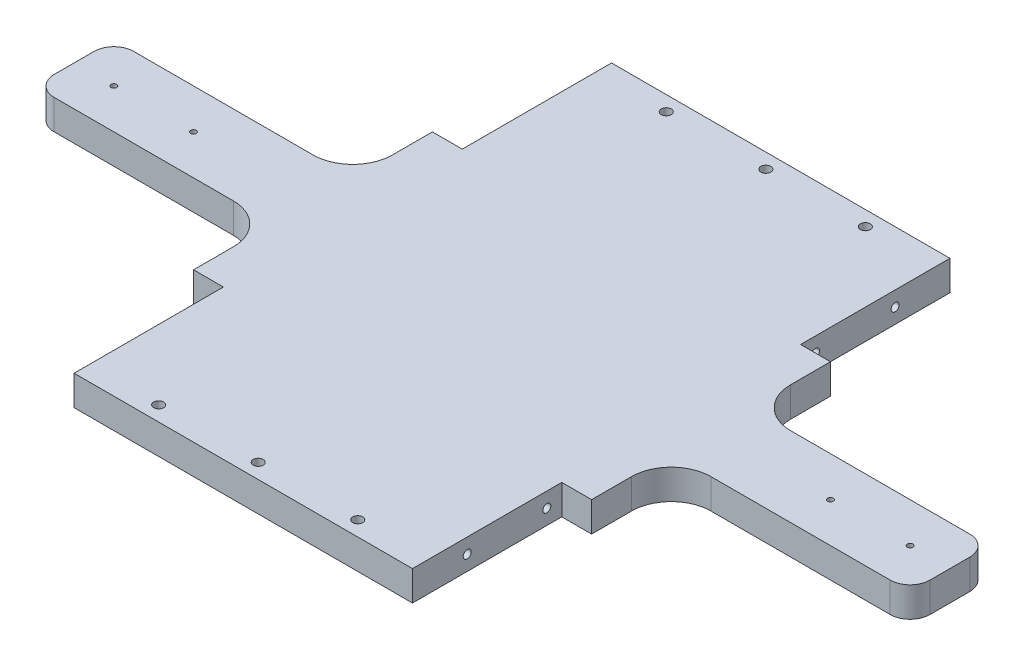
ISO-10303-21;
HEADER;
FILE_DESCRIPTION(('STEP AP214'),'2;1');
FILE_NAME('part.step','',(''),(''),'','','');
FILE_SCHEMA(('AUTOMOTIVE_DESIGN { 1 0 10303 214 1 1 1 1 }'));
ENDSEC;
DATA;
#1=APPLICATION_CONTEXT('core data for automotive mechanical design processes');
#2=APPLICATION_PROTOCOL_DEFINITION('international standard','automotive_design',2000,#1);
#3=PRODUCT_CONTEXT('',#1,'mechanical');
#4=PRODUCT('Part','Part','',(#3));
#5=PRODUCT_RELATED_PRODUCT_CATEGORY('part','',(#4));
#6=PRODUCT_DEFINITION_FORMATION('','',#4);
#7=PRODUCT_DEFINITION_CONTEXT('part definition',#1,'design');
#8=PRODUCT_DEFINITION('design','',#6,#7);
#9=PRODUCT_DEFINITION_SHAPE('','',#8);
#10=(LENGTH_UNIT() NAMED_UNIT(*) SI_UNIT(.MILLI.,.METRE.));
#11=(NAMED_UNIT(*) PLANE_ANGLE_UNIT() SI_UNIT($,.RADIAN.));
#12=(NAMED_UNIT(*) SI_UNIT($,.STERADIAN.) SOLID_ANGLE_UNIT());
#13=UNCERTAINTY_MEASURE_WITH_UNIT(LENGTH_MEASURE(1.E-05),#10,'distance_accuracy_value','');
#14=(GEOMETRIC_REPRESENTATION_CONTEXT(3) GLOBAL_UNCERTAINTY_ASSIGNED_CONTEXT((#13)) GLOBAL_UNIT_ASSIGNED_CONTEXT((#10,
#11,#12)) REPRESENTATION_CONTEXT('',''));
#15=CARTESIAN_POINT('',(0.,0.,0.));
#16=DIRECTION('',(0.,0.,1.));
#17=DIRECTION('',(1.,0.,0.));
#18=AXIS2_PLACEMENT_3D('',#15,#16,#17);
#19=CARTESIAN_POINT('',(0.,19.05,171.45));
#20=DIRECTION('',(0.,0.,1.));
#21=DIRECTION('',(1.,0.,0.));
#22=AXIS2_PLACEMENT_3D('',#19,#20,#21);
#23=PLANE('',#22);
#24=DIRECTION('',(-1.,0.,0.));
#25=VECTOR('',#24,1.);
#26=CARTESIAN_POINT('',(0.,19.05,171.45));
#27=LINE('',#26,#25);
#28=CARTESIAN_POINT('',(107.95,19.05,171.45));
#29=VERTEX_POINT('',#28);
#30=CARTESIAN_POINT('',(-107.95,19.05,171.45));
#31=VERTEX_POINT('',#30);
#32=EDGE_CURVE('E435',#29,#31,#27,.T.);
#33=ORIENTED_EDGE('',*,*,#32,.T.);
#34=DIRECTION('',(0.,1.,0.));
#35=VECTOR('',#34,1.);
#36=CARTESIAN_POINT('',(-107.95,19.05,171.45));
#37=LINE('',#36,#35);
#38=CARTESIAN_POINT('',(-107.95,0.,171.45));
#39=VERTEX_POINT('',#38);
#40=EDGE_CURVE('E306',#39,#31,#37,.T.);
#41=ORIENTED_EDGE('',*,*,#40,.F.);
#42=DIRECTION('',(-1.,0.,0.));
#43=VECTOR('',#42,1.);
#44=CARTESIAN_POINT('',(0.,0.,171.45));
#45=LINE('',#44,#43);
#46=CARTESIAN_POINT('',(107.95,0.,171.45));
#47=VERTEX_POINT('',#46);
#48=EDGE_CURVE('E459',#47,#39,#45,.T.);
#49=ORIENTED_EDGE('',*,*,#48,.F.);
#50=DIRECTION('',(0.,1.,0.));
#51=VECTOR('',#50,1.);
#52=CARTESIAN_POINT('',(107.95,19.05,171.45));
#53=LINE('',#52,#51);
#54=EDGE_CURVE('E334',#47,#29,#53,.T.);
#55=ORIENTED_EDGE('',*,*,#54,.T.);
#56=EDGE_LOOP('',(#33,#41,#49,#55));
#57=FACE_BOUND('',#56,.T.);
#58=ADVANCED_FACE('F34',(#57),#23,.T.);
#59=CARTESIAN_POINT('',(0.,19.05,0.));
#60=DIRECTION('',(0.,1.,0.));
#61=DIRECTION('',(0.,0.,1.));
#62=AXIS2_PLACEMENT_3D('',#59,#60,#61);
#63=PLANE('',#62);
#64=DIRECTION('',(-1.,0.,0.));
#65=VECTOR('',#64,1.);
#66=CARTESIAN_POINT('',(-107.95,19.05,76.2));
#67=LINE('',#66,#65);
#68=CARTESIAN_POINT('',(-107.95,19.05,76.2));
#69=VERTEX_POINT('',#68);
#70=CARTESIAN_POINT('',(-127.,19.05,76.2));
#71=VERTEX_POINT('',#70);
#72=EDGE_CURVE('E49',#69,#71,#67,.T.);
#73=ORIENTED_EDGE('',*,*,#72,.F.);
#74=DIRECTION('',(0.,0.,-1.));
#75=VECTOR('',#74,1.);
#76=CARTESIAN_POINT('',(-107.95,19.05,171.45));
#77=LINE('',#76,#75);
#78=EDGE_CURVE('E298',#31,#69,#77,.T.);
#79=ORIENTED_EDGE('',*,*,#78,.F.);
#80=ORIENTED_EDGE('',*,*,#32,.F.);
#81=DIRECTION('',(0.,0.,-1.));
#82=VECTOR('',#81,1.);
#83=CARTESIAN_POINT('',(107.95,19.05,171.45));
#84=LINE('',#83,#82);
#85=CARTESIAN_POINT('',(107.95,19.05,76.2));
#86=VERTEX_POINT('',#85);
#87=EDGE_CURVE('E331',#29,#86,#84,.T.);
#88=ORIENTED_EDGE('',*,*,#87,.T.);
#89=DIRECTION('',(1.,0.,0.));
#90=VECTOR('',#89,1.);
#91=CARTESIAN_POINT('',(107.95,19.05,76.2));
#92=LINE('',#91,#90);
#93=CARTESIAN_POINT('',(127.,19.05,76.2));
#94=VERTEX_POINT('',#93);
#95=EDGE_CURVE('E345',#86,#94,#92,.T.);
#96=ORIENTED_EDGE('',*,*,#95,.T.);
#97=DIRECTION('',(0.,0.,-1.));
#98=VECTOR('',#97,1.);
#99=CARTESIAN_POINT('',(127.,19.05,0.));
#100=LINE('',#99,#98);
#101=CARTESIAN_POINT('',(127.,19.05,50.8));
#102=VERTEX_POINT('',#101);
#103=EDGE_CURVE('E439',#94,#102,#100,.T.);
#104=ORIENTED_EDGE('',*,*,#103,.T.);
#105=CARTESIAN_POINT('',(152.4,19.05,50.8));
#106=DIRECTION('',(0.,1.,0.));
#107=DIRECTION('',(0.,0.,1.));
#108=AXIS2_PLACEMENT_3D('',#105,#106,#107);
#109=CIRCLE('',#108,25.4);
#110=CARTESIAN_POINT('',(152.4,19.05,25.4));
#111=VERTEX_POINT('',#110);
#112=EDGE_CURVE('E537',#102,#111,#109,.F.);
#113=ORIENTED_EDGE('',*,*,#112,.T.);
#114=DIRECTION('',(1.,0.,0.));
#115=VECTOR('',#114,1.);
#116=CARTESIAN_POINT('',(0.,19.05,25.4));
#117=LINE('',#116,#115);
#118=CARTESIAN_POINT('',(266.7,19.05,25.4));
#119=VERTEX_POINT('',#118);
#120=EDGE_CURVE('E441',#111,#119,#117,.T.);
#121=ORIENTED_EDGE('',*,*,#120,.T.);
#122=CARTESIAN_POINT('',(266.7,19.05,12.7));
#123=DIRECTION('',(0.,1.,0.));
#124=DIRECTION('',(0.,0.,1.));
#125=AXIS2_PLACEMENT_3D('',#122,#123,#124);
#126=CIRCLE('',#125,12.7);
#127=CARTESIAN_POINT('',(279.4,19.05,12.7));
#128=VERTEX_POINT('',#127);
#129=EDGE_CURVE('E517',#119,#128,#126,.T.);
#130=ORIENTED_EDGE('',*,*,#129,.T.);
#131=DIRECTION('',(0.,0.,1.));
#132=VECTOR('',#131,1.);
#133=CARTESIAN_POINT('',(279.4,19.05,0.));
#134=LINE('',#133,#132);
#135=CARTESIAN_POINT('',(279.4,19.05,-12.7));
#136=VERTEX_POINT('',#135);
#137=EDGE_CURVE('E444',#136,#128,#134,.T.);
#138=ORIENTED_EDGE('',*,*,#137,.F.);
#139=CARTESIAN_POINT('',(266.7,19.05,-12.7));
#140=DIRECTION('',(0.,1.,0.));
#141=DIRECTION('',(0.,0.,1.));
#142=AXIS2_PLACEMENT_3D('',#139,#140,#141);
#143=CIRCLE('',#142,12.7);
#144=CARTESIAN_POINT('',(266.7,19.05,-25.4));
#145=VERTEX_POINT('',#144);
#146=EDGE_CURVE('E505',#136,#145,#143,.T.);
#147=ORIENTED_EDGE('',*,*,#146,.T.);
#148=DIRECTION('',(1.,0.,0.));
#149=VECTOR('',#148,1.);
#150=CARTESIAN_POINT('',(0.,19.05,-25.4));
#151=LINE('',#150,#149);
#152=CARTESIAN_POINT('',(152.4,19.05,-25.4));
#153=VERTEX_POINT('',#152);
#154=EDGE_CURVE('E447',#153,#145,#151,.T.);
#155=ORIENTED_EDGE('',*,*,#154,.F.);
#156=CARTESIAN_POINT('',(152.4,19.05,-50.8));
#157=DIRECTION('',(0.,1.,0.));
#158=DIRECTION('',(0.,0.,1.));
#159=AXIS2_PLACEMENT_3D('',#156,#157,#158);
#160=CIRCLE('',#159,25.4);
#161=CARTESIAN_POINT('',(127.,19.05,-50.8));
#162=VERTEX_POINT('',#161);
#163=EDGE_CURVE('E526',#153,#162,#160,.F.);
#164=ORIENTED_EDGE('',*,*,#163,.T.);
#165=CARTESIAN_POINT('',(127.,19.05,-76.2));
#166=VERTEX_POINT('',#165);
#167=EDGE_CURVE('E442',#162,#166,#100,.T.);
#168=ORIENTED_EDGE('',*,*,#167,.T.);
#169=DIRECTION('',(1.,0.,0.));
#170=VECTOR('',#169,1.);
#171=CARTESIAN_POINT('',(107.95,19.05,-76.2));
#172=LINE('',#171,#170);
#173=CARTESIAN_POINT('',(107.95,19.05,-76.2));
#174=VERTEX_POINT('',#173);
#175=EDGE_CURVE('E359',#174,#166,#172,.T.);
#176=ORIENTED_EDGE('',*,*,#175,.F.);
#177=DIRECTION('',(0.,0.,1.));
#178=VECTOR('',#177,1.);
#179=CARTESIAN_POINT('',(107.95,19.05,-171.45));
#180=LINE('',#179,#178);
#181=CARTESIAN_POINT('',(107.95,19.05,-171.45));
#182=VERTEX_POINT('',#181);
#183=EDGE_CURVE('E350',#182,#174,#180,.T.);
#184=ORIENTED_EDGE('',*,*,#183,.F.);
#185=DIRECTION('',(-1.,0.,0.));
#186=VECTOR('',#185,1.);
#187=CARTESIAN_POINT('',(0.,19.05,-171.45));
#188=LINE('',#187,#186);
#189=CARTESIAN_POINT('',(-107.95,19.05,-171.45));
#190=VERTEX_POINT('',#189);
#191=EDGE_CURVE('E449',#182,#190,#188,.T.);
#192=ORIENTED_EDGE('',*,*,#191,.T.);
#193=DIRECTION('',(0.,0.,1.));
#194=VECTOR('',#193,1.);
#195=CARTESIAN_POINT('',(-107.95,19.05,-171.45));
#196=LINE('',#195,#194);
#197=CARTESIAN_POINT('',(-107.95,19.05,-76.2));
#198=VERTEX_POINT('',#197);
#199=EDGE_CURVE('E314',#190,#198,#196,.T.);
#200=ORIENTED_EDGE('',*,*,#199,.T.);
#201=DIRECTION('',(-1.,0.,0.));
#202=VECTOR('',#201,1.);
#203=CARTESIAN_POINT('',(-107.95,19.05,-76.2));
#204=LINE('',#203,#202);
#205=CARTESIAN_POINT('',(-127.,19.05,-76.2));
#206=VERTEX_POINT('',#205);
#207=EDGE_CURVE('E326',#198,#206,#204,.T.);
#208=ORIENTED_EDGE('',*,*,#207,.T.);
#209=DIRECTION('',(0.,0.,-1.));
#210=VECTOR('',#209,1.);
#211=CARTESIAN_POINT('',(-127.,19.05,0.));
#212=LINE('',#211,#210);
#213=CARTESIAN_POINT('',(-127.,19.05,-50.7999999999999));
#214=VERTEX_POINT('',#213);
#215=EDGE_CURVE('E436',#214,#206,#212,.T.);
#216=ORIENTED_EDGE('',*,*,#215,.F.);
#217=CARTESIAN_POINT('',(-152.4,19.05,-50.7999999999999));
#218=DIRECTION('',(0.,1.,0.));
#219=DIRECTION('',(0.,0.,1.));
#220=AXIS2_PLACEMENT_3D('',#217,#218,#219);
#221=CIRCLE('',#220,25.4);
#222=CARTESIAN_POINT('',(-152.4,19.05,-25.3999999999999));
#223=VERTEX_POINT('',#222);
#224=EDGE_CURVE('E11',#214,#223,#221,.F.);
#225=ORIENTED_EDGE('',*,*,#224,.T.);
#226=DIRECTION('',(-1.,0.,0.));
#227=VECTOR('',#226,1.);
#228=CARTESIAN_POINT('',(0.,19.05,-25.4));
#229=LINE('',#228,#227);
#230=CARTESIAN_POINT('',(-266.7,19.05,-25.3999999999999));
#231=VERTEX_POINT('',#230);
#232=EDGE_CURVE('E426',#223,#231,#229,.T.);
#233=ORIENTED_EDGE('',*,*,#232,.T.);
#234=CARTESIAN_POINT('',(-266.7,19.05,-12.6999999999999));
#235=DIRECTION('',(0.,1.,0.));
#236=DIRECTION('',(0.,0.,1.));
#237=AXIS2_PLACEMENT_3D('',#234,#235,#236);
#238=CIRCLE('',#237,12.7);
#239=CARTESIAN_POINT('',(-279.4,19.05,-12.6999999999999));
#240=VERTEX_POINT('',#239);
#241=EDGE_CURVE('E496',#231,#240,#238,.T.);
#242=ORIENTED_EDGE('',*,*,#241,.T.);
#243=DIRECTION('',(0.,0.,1.));
#244=VECTOR('',#243,1.);
#245=CARTESIAN_POINT('',(-279.4,19.05,0.));
#246=LINE('',#245,#244);
#247=CARTESIAN_POINT('',(-279.4,19.05,12.7000000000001));
#248=VERTEX_POINT('',#247);
#249=EDGE_CURVE('E428',#240,#248,#246,.T.);
#250=ORIENTED_EDGE('',*,*,#249,.T.);
#251=CARTESIAN_POINT('',(-266.7,19.05,12.7000000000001));
#252=DIRECTION('',(0.,1.,0.));
#253=DIRECTION('',(0.,0.,1.));
#254=AXIS2_PLACEMENT_3D('',#251,#252,#253);
#255=CIRCLE('',#254,12.7);
#256=CARTESIAN_POINT('',(-266.7,19.05,25.4000000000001));
#257=VERTEX_POINT('',#256);
#258=EDGE_CURVE('E484',#248,#257,#255,.T.);
#259=ORIENTED_EDGE('',*,*,#258,.T.);
#260=DIRECTION('',(-1.,0.,0.));
#261=VECTOR('',#260,1.);
#262=CARTESIAN_POINT('',(0.,19.05,25.4));
#263=LINE('',#262,#261);
#264=CARTESIAN_POINT('',(-152.4,19.05,25.4000000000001));
#265=VERTEX_POINT('',#264);
#266=EDGE_CURVE('E431',#265,#257,#263,.T.);
#267=ORIENTED_EDGE('',*,*,#266,.F.);
#268=CARTESIAN_POINT('',(-152.4,19.05,50.8));
#269=DIRECTION('',(0.,1.,0.));
#270=DIRECTION('',(0.,0.,1.));
#271=AXIS2_PLACEMENT_3D('',#268,#269,#270);
#272=CIRCLE('',#271,25.4);
#273=CARTESIAN_POINT('',(-127.,19.05,50.8000000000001));
#274=VERTEX_POINT('',#273);
#275=EDGE_CURVE('E546',#265,#274,#272,.F.);
#276=ORIENTED_EDGE('',*,*,#275,.T.);
#277=EDGE_CURVE('E433',#71,#274,#212,.T.);
#278=ORIENTED_EDGE('',*,*,#277,.F.);
#279=EDGE_LOOP('',(#73,#79,#80,#88,#96,#104,#113,#121,#130,#138,#147,#155,#164,#168,#176,#184,
#192,#200,#208,#216,#225,#233,#242,#250,#259,#267,#276,#278));
#280=FACE_BOUND('',#279,.T.);
#281=CARTESIAN_POINT('',(0.,19.05,161.925));
#282=DIRECTION('',(0.,1.,0.));
#283=DIRECTION('',(0.,0.,1.));
#284=AXIS2_PLACEMENT_3D('',#281,#282,#283);
#285=CIRCLE('',#284,3.175);
#286=CARTESIAN_POINT('',(0.,19.05,165.1));
#287=VERTEX_POINT('',#286);
#288=EDGE_CURVE('E364',#287,#287,#285,.T.);
#289=ORIENTED_EDGE('',*,*,#288,.F.);
#290=EDGE_LOOP('',(#289));
#291=FACE_BOUND('',#290,.T.);
#292=CARTESIAN_POINT('',(-63.5,19.05,161.925));
#293=DIRECTION('',(0.,1.,0.));
#294=DIRECTION('',(0.,0.,1.));
#295=AXIS2_PLACEMENT_3D('',#292,#293,#294);
#296=CIRCLE('',#295,3.175);
#297=CARTESIAN_POINT('',(-63.5,19.05,165.1));
#298=VERTEX_POINT('',#297);
#299=EDGE_CURVE('E371',#298,#298,#296,.T.);
#300=ORIENTED_EDGE('',*,*,#299,.F.);
#301=EDGE_LOOP('',(#300));
#302=FACE_BOUND('',#301,.T.);
#303=CARTESIAN_POINT('',(63.5,19.05,161.925));
#304=DIRECTION('',(0.,1.,0.));
#305=DIRECTION('',(0.,0.,1.));
#306=AXIS2_PLACEMENT_3D('',#303,#304,#305);
#307=CIRCLE('',#306,3.175);
#308=CARTESIAN_POINT('',(63.5,19.05,165.1));
#309=VERTEX_POINT('',#308);
#310=EDGE_CURVE('E377',#309,#309,#307,.T.);
#311=ORIENTED_EDGE('',*,*,#310,.F.);
#312=EDGE_LOOP('',(#311));
#313=FACE_BOUND('',#312,.T.);
#314=CARTESIAN_POINT('',(0.,19.05,-161.925));
#315=DIRECTION('',(0.,1.,0.));
#316=DIRECTION('',(0.,0.,1.));
#317=AXIS2_PLACEMENT_3D('',#314,#315,#316);
#318=CIRCLE('',#317,3.175);
#319=CARTESIAN_POINT('',(0.,19.05,-158.75));
#320=VERTEX_POINT('',#319);
#321=EDGE_CURVE('E383',#320,#320,#318,.T.);
#322=ORIENTED_EDGE('',*,*,#321,.F.);
#323=EDGE_LOOP('',(#322));
#324=FACE_BOUND('',#323,.T.);
#325=CARTESIAN_POINT('',(-63.5,19.05,-161.925));
#326=DIRECTION('',(0.,1.,0.));
#327=DIRECTION('',(0.,0.,1.));
#328=AXIS2_PLACEMENT_3D('',#325,#326,#327);
#329=CIRCLE('',#328,3.175);
#330=CARTESIAN_POINT('',(-63.5,19.05,-158.75));
#331=VERTEX_POINT('',#330);
#332=EDGE_CURVE('E389',#331,#331,#329,.T.);
#333=ORIENTED_EDGE('',*,*,#332,.F.);
#334=EDGE_LOOP('',(#333));
#335=FACE_BOUND('',#334,.T.);
#336=CARTESIAN_POINT('',(63.5,19.05,-161.925));
#337=DIRECTION('',(0.,1.,0.));
#338=DIRECTION('',(0.,0.,1.));
#339=AXIS2_PLACEMENT_3D('',#336,#337,#338);
#340=CIRCLE('',#339,3.175);
#341=CARTESIAN_POINT('',(63.5,19.05,-158.75));
#342=VERTEX_POINT('',#341);
#343=EDGE_CURVE('E395',#342,#342,#340,.T.);
#344=ORIENTED_EDGE('',*,*,#343,.F.);
#345=EDGE_LOOP('',(#344));
#346=FACE_BOUND('',#345,.T.);
#347=CARTESIAN_POINT('',(254.,19.05,0.));
#348=DIRECTION('',(0.,1.,0.));
#349=DIRECTION('',(0.,0.,1.));
#350=AXIS2_PLACEMENT_3D('',#347,#348,#349);
#351=CIRCLE('',#350,1.77799999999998);
#352=CARTESIAN_POINT('',(254.,19.05,1.77799999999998));
#353=VERTEX_POINT('',#352);
#354=EDGE_CURVE('E401',#353,#353,#351,.T.);
#355=ORIENTED_EDGE('',*,*,#354,.F.);
#356=EDGE_LOOP('',(#355));
#357=FACE_BOUND('',#356,.T.);
#358=CARTESIAN_POINT('',(203.2,19.05,0.));
#359=DIRECTION('',(0.,1.,0.));
#360=DIRECTION('',(0.,0.,1.));
#361=AXIS2_PLACEMENT_3D('',#358,#359,#360);
#362=CIRCLE('',#361,1.77800000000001);
#363=CARTESIAN_POINT('',(203.2,19.05,1.77800000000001));
#364=VERTEX_POINT('',#363);
#365=EDGE_CURVE('E405',#364,#364,#362,.T.);
#366=ORIENTED_EDGE('',*,*,#365,.F.);
#367=EDGE_LOOP('',(#366));
#368=FACE_BOUND('',#367,.T.);
#369=CARTESIAN_POINT('',(-254.000002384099,19.05,0.0110051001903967));
#370=DIRECTION('',(0.,1.,0.));
#371=DIRECTION('',(0.,0.,1.));
#372=AXIS2_PLACEMENT_3D('',#369,#370,#371);
#373=CIRCLE('',#372,1.77799999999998);
#374=CARTESIAN_POINT('',(-254.000002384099,19.05,1.78900510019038));
#375=VERTEX_POINT('',#374);
#376=EDGE_CURVE('E411',#375,#375,#373,.T.);
#377=ORIENTED_EDGE('',*,*,#376,.F.);
#378=EDGE_LOOP('',(#377));
#379=FACE_BOUND('',#378,.T.);
#380=CARTESIAN_POINT('',(-203.200007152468,19.05,0.0330156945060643));
#381=DIRECTION('',(0.,1.,0.));
#382=DIRECTION('',(0.,0.,1.));
#383=AXIS2_PLACEMENT_3D('',#380,#381,#382);
#384=CIRCLE('',#383,1.77800000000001);
#385=CARTESIAN_POINT('',(-203.200007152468,19.05,1.81101569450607));
#386=VERTEX_POINT('',#385);
#387=EDGE_CURVE('E417',#386,#386,#384,.T.);
#388=ORIENTED_EDGE('',*,*,#387,.F.);
#389=EDGE_LOOP('',(#388));
#390=FACE_BOUND('',#389,.T.);
#391=ADVANCED_FACE('F569',(#280,#291,#302,#313,#324,#335,#346,#357,#368,#379,#390),#63,.T.);
#392=CARTESIAN_POINT('',(0.,0.,0.));
#393=DIRECTION('',(0.,1.,0.));
#394=DIRECTION('',(0.,0.,1.));
#395=AXIS2_PLACEMENT_3D('',#392,#393,#394);
#396=PLANE('',#395);
#397=CARTESIAN_POINT('',(0.,0.,161.925));
#398=DIRECTION('',(0.,1.,0.));
#399=DIRECTION('',(0.,0.,1.));
#400=AXIS2_PLACEMENT_3D('',#397,#398,#399);
#401=CIRCLE('',#400,3.175);
#402=CARTESIAN_POINT('',(0.,0.,165.1));
#403=VERTEX_POINT('',#402);
#404=EDGE_CURVE('E368',#403,#403,#401,.T.);
#405=ORIENTED_EDGE('',*,*,#404,.T.);
#406=EDGE_LOOP('',(#405));
#407=FACE_BOUND('',#406,.T.);
#408=CARTESIAN_POINT('',(-63.5,0.,161.925));
#409=DIRECTION('',(0.,1.,0.));
#410=DIRECTION('',(0.,0.,1.));
#411=AXIS2_PLACEMENT_3D('',#408,#409,#410);
#412=CIRCLE('',#411,3.175);
#413=CARTESIAN_POINT('',(-63.5,0.,165.1));
#414=VERTEX_POINT('',#413);
#415=EDGE_CURVE('E374',#414,#414,#412,.T.);
#416=ORIENTED_EDGE('',*,*,#415,.T.);
#417=EDGE_LOOP('',(#416));
#418=FACE_BOUND('',#417,.T.);
#419=CARTESIAN_POINT('',(63.5,0.,161.925));
#420=DIRECTION('',(0.,1.,0.));
#421=DIRECTION('',(0.,0.,1.));
#422=AXIS2_PLACEMENT_3D('',#419,#420,#421);
#423=CIRCLE('',#422,3.175);
#424=CARTESIAN_POINT('',(63.5,0.,165.1));
#425=VERTEX_POINT('',#424);
#426=EDGE_CURVE('E380',#425,#425,#423,.T.);
#427=ORIENTED_EDGE('',*,*,#426,.T.);
#428=EDGE_LOOP('',(#427));
#429=FACE_BOUND('',#428,.T.);
#430=CARTESIAN_POINT('',(0.,0.,-161.925));
#431=DIRECTION('',(0.,1.,0.));
#432=DIRECTION('',(0.,0.,1.));
#433=AXIS2_PLACEMENT_3D('',#430,#431,#432);
#434=CIRCLE('',#433,3.175);
#435=CARTESIAN_POINT('',(0.,0.,-158.75));
#436=VERTEX_POINT('',#435);
#437=EDGE_CURVE('E386',#436,#436,#434,.T.);
#438=ORIENTED_EDGE('',*,*,#437,.T.);
#439=EDGE_LOOP('',(#438));
#440=FACE_BOUND('',#439,.T.);
#441=CARTESIAN_POINT('',(-63.5,0.,-161.925));
#442=DIRECTION('',(0.,1.,0.));
#443=DIRECTION('',(0.,0.,1.));
#444=AXIS2_PLACEMENT_3D('',#441,#442,#443);
#445=CIRCLE('',#444,3.175);
#446=CARTESIAN_POINT('',(-63.5,0.,-158.75));
#447=VERTEX_POINT('',#446);
#448=EDGE_CURVE('E392',#447,#447,#445,.T.);
#449=ORIENTED_EDGE('',*,*,#448,.T.);
#450=EDGE_LOOP('',(#449));
#451=FACE_BOUND('',#450,.T.);
#452=CARTESIAN_POINT('',(63.5,0.,-161.925));
#453=DIRECTION('',(0.,1.,0.));
#454=DIRECTION('',(0.,0.,1.));
#455=AXIS2_PLACEMENT_3D('',#452,#453,#454);
#456=CIRCLE('',#455,3.175);
#457=CARTESIAN_POINT('',(63.5,0.,-158.75));
#458=VERTEX_POINT('',#457);
#459=EDGE_CURVE('E398',#458,#458,#456,.T.);
#460=ORIENTED_EDGE('',*,*,#459,.T.);
#461=EDGE_LOOP('',(#460));
#462=FACE_BOUND('',#461,.T.);
#463=CARTESIAN_POINT('',(254.,0.,0.));
#464=DIRECTION('',(0.,1.,0.));
#465=DIRECTION('',(0.,0.,1.));
#466=AXIS2_PLACEMENT_3D('',#463,#464,#465);
#467=CIRCLE('',#466,1.77799999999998);
#468=CARTESIAN_POINT('',(254.,0.,1.77799999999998));
#469=VERTEX_POINT('',#468);
#470=EDGE_CURVE('E402',#469,#469,#467,.T.);
#471=ORIENTED_EDGE('',*,*,#470,.T.);
#472=EDGE_LOOP('',(#471));
#473=FACE_BOUND('',#472,.T.);
#474=CARTESIAN_POINT('',(203.2,0.,0.));
#475=DIRECTION('',(0.,1.,0.));
#476=DIRECTION('',(0.,0.,1.));
#477=AXIS2_PLACEMENT_3D('',#474,#475,#476);
#478=CIRCLE('',#477,1.77800000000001);
#479=CARTESIAN_POINT('',(203.2,0.,1.77800000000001));
#480=VERTEX_POINT('',#479);
#481=EDGE_CURVE('E408',#480,#480,#478,.T.);
#482=ORIENTED_EDGE('',*,*,#481,.T.);
#483=EDGE_LOOP('',(#482));
#484=FACE_BOUND('',#483,.T.);
#485=CARTESIAN_POINT('',(-254.000002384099,0.,0.0110051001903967));
#486=DIRECTION('',(0.,1.,0.));
#487=DIRECTION('',(0.,0.,1.));
#488=AXIS2_PLACEMENT_3D('',#485,#486,#487);
#489=CIRCLE('',#488,1.77799999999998);
#490=CARTESIAN_POINT('',(-254.000002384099,0.,1.78900510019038));
#491=VERTEX_POINT('',#490);
#492=EDGE_CURVE('E414',#491,#491,#489,.T.);
#493=ORIENTED_EDGE('',*,*,#492,.T.);
#494=EDGE_LOOP('',(#493));
#495=FACE_BOUND('',#494,.T.);
#496=CARTESIAN_POINT('',(-203.200007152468,0.,0.0330156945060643));
#497=DIRECTION('',(0.,1.,0.));
#498=DIRECTION('',(0.,0.,1.));
#499=AXIS2_PLACEMENT_3D('',#496,#497,#498);
#500=CIRCLE('',#499,1.77800000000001);
#501=CARTESIAN_POINT('',(-203.200007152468,0.,1.81101569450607));
#502=VERTEX_POINT('',#501);
#503=EDGE_CURVE('E420',#502,#502,#500,.T.);
#504=ORIENTED_EDGE('',*,*,#503,.T.);
#505=EDGE_LOOP('',(#504));
#506=FACE_BOUND('',#505,.T.);
#507=DIRECTION('',(0.,0.,1.));
#508=VECTOR('',#507,1.);
#509=CARTESIAN_POINT('',(-107.95,0.,171.45));
#510=LINE('',#509,#508);
#511=CARTESIAN_POINT('',(-107.95,0.,76.2));
#512=VERTEX_POINT('',#511);
#513=EDGE_CURVE('E304',#512,#39,#510,.T.);
#514=ORIENTED_EDGE('',*,*,#513,.F.);
#515=DIRECTION('',(-1.,0.,0.));
#516=VECTOR('',#515,1.);
#517=CARTESIAN_POINT('',(-107.95,0.,76.2));
#518=LINE('',#517,#516);
#519=CARTESIAN_POINT('',(-127.,0.,76.2));
#520=VERTEX_POINT('',#519);
#521=EDGE_CURVE('E309',#512,#520,#518,.T.);
#522=ORIENTED_EDGE('',*,*,#521,.T.);
#523=DIRECTION('',(0.,0.,-1.));
#524=VECTOR('',#523,1.);
#525=CARTESIAN_POINT('',(-127.,0.,0.));
#526=LINE('',#525,#524);
#527=CARTESIAN_POINT('',(-127.,0.,50.8000000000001));
#528=VERTEX_POINT('',#527);
#529=EDGE_CURVE('E457',#520,#528,#526,.T.);
#530=ORIENTED_EDGE('',*,*,#529,.T.);
#531=CARTESIAN_POINT('',(-152.4,0.,50.8));
#532=DIRECTION('',(0.,1.,0.));
#533=DIRECTION('',(0.,0.,1.));
#534=AXIS2_PLACEMENT_3D('',#531,#532,#533);
#535=CIRCLE('',#534,25.4);
#536=CARTESIAN_POINT('',(-152.4,0.,25.4000000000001));
#537=VERTEX_POINT('',#536);
#538=EDGE_CURVE('E544',#528,#537,#535,.T.);
#539=ORIENTED_EDGE('',*,*,#538,.T.);
#540=DIRECTION('',(-1.,0.,0.));
#541=VECTOR('',#540,1.);
#542=CARTESIAN_POINT('',(0.,0.,25.4));
#543=LINE('',#542,#541);
#544=CARTESIAN_POINT('',(-266.7,0.,25.4000000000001));
#545=VERTEX_POINT('',#544);
#546=EDGE_CURVE('E455',#537,#545,#543,.T.);
#547=ORIENTED_EDGE('',*,*,#546,.T.);
#548=CARTESIAN_POINT('',(-266.7,0.,12.7000000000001));
#549=DIRECTION('',(0.,1.,0.));
#550=DIRECTION('',(0.,0.,1.));
#551=AXIS2_PLACEMENT_3D('',#548,#549,#550);
#552=CIRCLE('',#551,12.7);
#553=CARTESIAN_POINT('',(-279.4,0.,12.7000000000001));
#554=VERTEX_POINT('',#553);
#555=EDGE_CURVE('E478',#545,#554,#552,.F.);
#556=ORIENTED_EDGE('',*,*,#555,.T.);
#557=DIRECTION('',(0.,0.,1.));
#558=VECTOR('',#557,1.);
#559=CARTESIAN_POINT('',(-279.4,0.,0.));
#560=LINE('',#559,#558);
#561=CARTESIAN_POINT('',(-279.4,0.,-12.6999999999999));
#562=VERTEX_POINT('',#561);
#563=EDGE_CURVE('E453',#562,#554,#560,.T.);
#564=ORIENTED_EDGE('',*,*,#563,.F.);
#565=CARTESIAN_POINT('',(-266.7,0.,-12.6999999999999));
#566=DIRECTION('',(0.,1.,0.));
#567=DIRECTION('',(0.,0.,1.));
#568=AXIS2_PLACEMENT_3D('',#565,#566,#567);
#569=CIRCLE('',#568,12.7);
#570=CARTESIAN_POINT('',(-266.7,0.,-25.3999999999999));
#571=VERTEX_POINT('',#570);
#572=EDGE_CURVE('E490',#562,#571,#569,.F.);
#573=ORIENTED_EDGE('',*,*,#572,.T.);
#574=DIRECTION('',(-1.,0.,0.));
#575=VECTOR('',#574,1.);
#576=CARTESIAN_POINT('',(0.,0.,-25.4));
#577=LINE('',#576,#575);
#578=CARTESIAN_POINT('',(-152.4,0.,-25.3999999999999));
#579=VERTEX_POINT('',#578);
#580=EDGE_CURVE('E423',#579,#571,#577,.T.);
#581=ORIENTED_EDGE('',*,*,#580,.F.);
#582=CARTESIAN_POINT('',(-152.4,0.,-50.7999999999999));
#583=DIRECTION('',(0.,1.,0.));
#584=DIRECTION('',(0.,0.,1.));
#585=AXIS2_PLACEMENT_3D('',#582,#583,#584);
#586=CIRCLE('',#585,25.4);
#587=CARTESIAN_POINT('',(-127.,0.,-50.7999999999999));
#588=VERTEX_POINT('',#587);
#589=EDGE_CURVE('E42',#579,#588,#586,.T.);
#590=ORIENTED_EDGE('',*,*,#589,.T.);
#591=CARTESIAN_POINT('',(-127.,0.,-76.2));
#592=VERTEX_POINT('',#591);
#593=EDGE_CURVE('E429',#588,#592,#526,.T.);
#594=ORIENTED_EDGE('',*,*,#593,.T.);
#595=DIRECTION('',(-1.,0.,0.));
#596=VECTOR('',#595,1.);
#597=CARTESIAN_POINT('',(-107.95,0.,-76.2));
#598=LINE('',#597,#596);
#599=CARTESIAN_POINT('',(-107.95,0.,-76.2));
#600=VERTEX_POINT('',#599);
#601=EDGE_CURVE('E57',#600,#592,#598,.T.);
#602=ORIENTED_EDGE('',*,*,#601,.F.);
#603=DIRECTION('',(0.,0.,-1.));
#604=VECTOR('',#603,1.);
#605=CARTESIAN_POINT('',(-107.95,0.,-171.45));
#606=LINE('',#605,#604);
#607=CARTESIAN_POINT('',(-107.95,0.,-171.45));
#608=VERTEX_POINT('',#607);
#609=EDGE_CURVE('E320',#600,#608,#606,.T.);
#610=ORIENTED_EDGE('',*,*,#609,.T.);
#611=DIRECTION('',(-1.,0.,0.));
#612=VECTOR('',#611,1.);
#613=CARTESIAN_POINT('',(0.,0.,-171.45));
#614=LINE('',#613,#612);
#615=CARTESIAN_POINT('',(107.95,0.,-171.45));
#616=VERTEX_POINT('',#615);
#617=EDGE_CURVE('E472',#616,#608,#614,.T.);
#618=ORIENTED_EDGE('',*,*,#617,.F.);
#619=DIRECTION('',(0.,0.,-1.));
#620=VECTOR('',#619,1.);
#621=CARTESIAN_POINT('',(107.95,0.,-171.45));
#622=LINE('',#621,#620);
#623=CARTESIAN_POINT('',(107.95,0.,-76.2));
#624=VERTEX_POINT('',#623);
#625=EDGE_CURVE('E355',#624,#616,#622,.T.);
#626=ORIENTED_EDGE('',*,*,#625,.F.);
#627=DIRECTION('',(1.,0.,0.));
#628=VECTOR('',#627,1.);
#629=CARTESIAN_POINT('',(107.95,0.,-76.2));
#630=LINE('',#629,#628);
#631=CARTESIAN_POINT('',(127.,0.,-76.2));
#632=VERTEX_POINT('',#631);
#633=EDGE_CURVE('E361',#624,#632,#630,.T.);
#634=ORIENTED_EDGE('',*,*,#633,.T.);
#635=DIRECTION('',(0.,0.,-1.));
#636=VECTOR('',#635,1.);
#637=CARTESIAN_POINT('',(127.,0.,0.));
#638=LINE('',#637,#636);
#639=CARTESIAN_POINT('',(127.,0.,-50.8));
#640=VERTEX_POINT('',#639);
#641=EDGE_CURVE('E465',#640,#632,#638,.T.);
#642=ORIENTED_EDGE('',*,*,#641,.F.);
#643=CARTESIAN_POINT('',(152.4,0.,-50.8));
#644=DIRECTION('',(0.,1.,0.));
#645=DIRECTION('',(0.,0.,1.));
#646=AXIS2_PLACEMENT_3D('',#643,#644,#645);
#647=CIRCLE('',#646,25.4);
#648=CARTESIAN_POINT('',(152.4,0.,-25.4));
#649=VERTEX_POINT('',#648);
#650=EDGE_CURVE('E524',#640,#649,#647,.T.);
#651=ORIENTED_EDGE('',*,*,#650,.T.);
#652=DIRECTION('',(1.,0.,0.));
#653=VECTOR('',#652,1.);
#654=CARTESIAN_POINT('',(0.,0.,-25.4));
#655=LINE('',#654,#653);
#656=CARTESIAN_POINT('',(266.7,0.,-25.4));
#657=VERTEX_POINT('',#656);
#658=EDGE_CURVE('E470',#649,#657,#655,.T.);
#659=ORIENTED_EDGE('',*,*,#658,.T.);
#660=CARTESIAN_POINT('',(266.7,0.,-12.7));
#661=DIRECTION('',(0.,1.,0.));
#662=DIRECTION('',(0.,0.,1.));
#663=AXIS2_PLACEMENT_3D('',#660,#661,#662);
#664=CIRCLE('',#663,12.7);
#665=CARTESIAN_POINT('',(279.4,0.,-12.7));
#666=VERTEX_POINT('',#665);
#667=EDGE_CURVE('E501',#657,#666,#664,.F.);
#668=ORIENTED_EDGE('',*,*,#667,.T.);
#669=DIRECTION('',(0.,0.,1.));
#670=VECTOR('',#669,1.);
#671=CARTESIAN_POINT('',(279.4,0.,0.));
#672=LINE('',#671,#670);
#673=CARTESIAN_POINT('',(279.4,0.,12.7));
#674=VERTEX_POINT('',#673);
#675=EDGE_CURVE('E467',#666,#674,#672,.T.);
#676=ORIENTED_EDGE('',*,*,#675,.T.);
#677=CARTESIAN_POINT('',(266.7,0.,12.7));
#678=DIRECTION('',(0.,1.,0.));
#679=DIRECTION('',(0.,0.,1.));
#680=AXIS2_PLACEMENT_3D('',#677,#678,#679);
#681=CIRCLE('',#680,12.7);
#682=CARTESIAN_POINT('',(266.7,0.,25.4));
#683=VERTEX_POINT('',#682);
#684=EDGE_CURVE('E511',#674,#683,#681,.F.);
#685=ORIENTED_EDGE('',*,*,#684,.T.);
#686=DIRECTION('',(1.,0.,0.));
#687=VECTOR('',#686,1.);
#688=CARTESIAN_POINT('',(0.,0.,25.4));
#689=LINE('',#688,#687);
#690=CARTESIAN_POINT('',(152.4,0.,25.4));
#691=VERTEX_POINT('',#690);
#692=EDGE_CURVE('E464',#691,#683,#689,.T.);
#693=ORIENTED_EDGE('',*,*,#692,.F.);
#694=CARTESIAN_POINT('',(152.4,0.,50.8));
#695=DIRECTION('',(0.,1.,0.));
#696=DIRECTION('',(0.,0.,1.));
#697=AXIS2_PLACEMENT_3D('',#694,#695,#696);
#698=CIRCLE('',#697,25.4);
#699=CARTESIAN_POINT('',(127.,0.,50.8));
#700=VERTEX_POINT('',#699);
#701=EDGE_CURVE('E534',#691,#700,#698,.T.);
#702=ORIENTED_EDGE('',*,*,#701,.T.);
#703=CARTESIAN_POINT('',(127.,0.,76.2));
#704=VERTEX_POINT('',#703);
#705=EDGE_CURVE('E462',#704,#700,#638,.T.);
#706=ORIENTED_EDGE('',*,*,#705,.F.);
#707=DIRECTION('',(1.,0.,0.));
#708=VECTOR('',#707,1.);
#709=CARTESIAN_POINT('',(107.95,0.,76.2));
#710=LINE('',#709,#708);
#711=CARTESIAN_POINT('',(107.95,0.,76.2));
#712=VERTEX_POINT('',#711);
#713=EDGE_CURVE('E342',#712,#704,#710,.T.);
#714=ORIENTED_EDGE('',*,*,#713,.F.);
#715=DIRECTION('',(0.,0.,1.));
#716=VECTOR('',#715,1.);
#717=CARTESIAN_POINT('',(107.95,0.,171.45));
#718=LINE('',#717,#716);
#719=EDGE_CURVE('E337',#712,#47,#718,.T.);
#720=ORIENTED_EDGE('',*,*,#719,.T.);
#721=ORIENTED_EDGE('',*,*,#48,.T.);
#722=EDGE_LOOP('',(#514,#522,#530,#539,#547,#556,#564,#573,#581,#590,#594,#602,#610,#618,#626,
#634,#642,#651,#659,#668,#676,#685,#693,#702,#706,#714,#720,#721));
#723=FACE_BOUND('',#722,.T.);
#724=ADVANCED_FACE('F558',(#407,#418,#429,#440,#451,#462,#473,#484,#495,#506,#723),#396,.F.);
#725=CARTESIAN_POINT('',(0.,19.05,-171.45));
#726=DIRECTION('',(0.,0.,1.));
#727=DIRECTION('',(1.,0.,0.));
#728=AXIS2_PLACEMENT_3D('',#725,#726,#727);
#729=PLANE('',#728);
#730=DIRECTION('',(0.,1.,0.));
#731=VECTOR('',#730,1.);
#732=CARTESIAN_POINT('',(-107.95,19.05,-171.45));
#733=LINE('',#732,#731);
#734=EDGE_CURVE('E317',#608,#190,#733,.T.);
#735=ORIENTED_EDGE('',*,*,#734,.T.);
#736=ORIENTED_EDGE('',*,*,#191,.F.);
#737=DIRECTION('',(0.,1.,0.));
#738=VECTOR('',#737,1.);
#739=CARTESIAN_POINT('',(107.95,19.05,-171.45));
#740=LINE('',#739,#738);
#741=EDGE_CURVE('E357',#616,#182,#740,.T.);
#742=ORIENTED_EDGE('',*,*,#741,.F.);
#743=ORIENTED_EDGE('',*,*,#617,.T.);
#744=EDGE_LOOP('',(#735,#736,#742,#743));
#745=FACE_BOUND('',#744,.T.);
#746=ADVANCED_FACE('F667',(#745),#729,.F.);
#747=CARTESIAN_POINT('',(-127.,19.05,0.));
#748=DIRECTION('',(-1.,0.,0.));
#749=DIRECTION('',(0.,0.,1.));
#750=AXIS2_PLACEMENT_3D('',#747,#748,#749);
#751=PLANE('',#750);
#752=ORIENTED_EDGE('',*,*,#215,.T.);
#753=DIRECTION('',(0.,-1.,0.));
#754=VECTOR('',#753,1.);
#755=CARTESIAN_POINT('',(-127.,19.05,-76.2));
#756=LINE('',#755,#754);
#757=EDGE_CURVE('E312',#206,#592,#756,.T.);
#758=ORIENTED_EDGE('',*,*,#757,.T.);
#759=ORIENTED_EDGE('',*,*,#593,.F.);
#760=DIRECTION('',(0.,-1.,0.));
#761=VECTOR('',#760,1.);
#762=CARTESIAN_POINT('',(-127.,19.05,-50.7999999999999));
#763=LINE('',#762,#761);
#764=EDGE_CURVE('E552',#588,#214,#763,.F.);
#765=ORIENTED_EDGE('',*,*,#764,.T.);
#766=EDGE_LOOP('',(#752,#758,#759,#765));
#767=FACE_BOUND('',#766,.T.);
#768=ADVANCED_FACE('F564',(#767),#751,.T.);
#769=CARTESIAN_POINT('',(127.,19.05,0.));
#770=DIRECTION('',(-1.,0.,0.));
#771=DIRECTION('',(0.,0.,1.));
#772=AXIS2_PLACEMENT_3D('',#769,#770,#771);
#773=PLANE('',#772);
#774=DIRECTION('',(0.,-1.,0.));
#775=VECTOR('',#774,1.);
#776=CARTESIAN_POINT('',(127.,19.05,76.2));
#777=LINE('',#776,#775);
#778=EDGE_CURVE('E329',#94,#704,#777,.T.);
#779=ORIENTED_EDGE('',*,*,#778,.T.);
#780=ORIENTED_EDGE('',*,*,#705,.T.);
#781=DIRECTION('',(0.,-1.,0.));
#782=VECTOR('',#781,1.);
#783=CARTESIAN_POINT('',(127.,19.05,50.8));
#784=LINE('',#783,#782);
#785=EDGE_CURVE('E531',#700,#102,#784,.F.);
#786=ORIENTED_EDGE('',*,*,#785,.T.);
#787=ORIENTED_EDGE('',*,*,#103,.F.);
#788=EDGE_LOOP('',(#779,#780,#786,#787));
#789=FACE_BOUND('',#788,.T.);
#790=ADVANCED_FACE('F616',(#789),#773,.F.);
#791=CARTESIAN_POINT('',(0.,19.05,-25.4));
#792=DIRECTION('',(0.,0.,1.));
#793=DIRECTION('',(1.,0.,0.));
#794=AXIS2_PLACEMENT_3D('',#791,#792,#793);
#795=PLANE('',#794);
#796=ORIENTED_EDGE('',*,*,#232,.F.);
#797=DIRECTION('',(0.,-1.,0.));
#798=VECTOR('',#797,1.);
#799=CARTESIAN_POINT('',(-152.4,19.05,-25.3999999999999));
#800=LINE('',#799,#798);
#801=EDGE_CURVE('E549',#223,#579,#800,.T.);
#802=ORIENTED_EDGE('',*,*,#801,.T.);
#803=ORIENTED_EDGE('',*,*,#580,.T.);
#804=DIRECTION('',(0.,-1.,0.));
#805=VECTOR('',#804,1.);
#806=CARTESIAN_POINT('',(-266.7,19.05,-25.3999999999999));
#807=LINE('',#806,#805);
#808=EDGE_CURVE('E493',#571,#231,#807,.F.);
#809=ORIENTED_EDGE('',*,*,#808,.T.);
#810=EDGE_LOOP('',(#796,#802,#803,#809));
#811=FACE_BOUND('',#810,.T.);
#812=ADVANCED_FACE('F572',(#811),#795,.F.);
#813=CARTESIAN_POINT('',(-279.4,19.05,0.));
#814=DIRECTION('',(1.,0.,0.));
#815=DIRECTION('',(0.,0.,-1.));
#816=AXIS2_PLACEMENT_3D('',#813,#814,#815);
#817=PLANE('',#816);
#818=ORIENTED_EDGE('',*,*,#249,.F.);
#819=DIRECTION('',(0.,-1.,0.));
#820=VECTOR('',#819,1.);
#821=CARTESIAN_POINT('',(-279.4,19.05,-12.6999999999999));
#822=LINE('',#821,#820);
#823=EDGE_CURVE('E487',#240,#562,#822,.T.);
#824=ORIENTED_EDGE('',*,*,#823,.T.);
#825=ORIENTED_EDGE('',*,*,#563,.T.);
#826=DIRECTION('',(0.,-1.,0.));
#827=VECTOR('',#826,1.);
#828=CARTESIAN_POINT('',(-279.4,19.05,12.7000000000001));
#829=LINE('',#828,#827);
#830=EDGE_CURVE('E481',#554,#248,#829,.F.);
#831=ORIENTED_EDGE('',*,*,#830,.T.);
#832=EDGE_LOOP('',(#818,#824,#825,#831));
#833=FACE_BOUND('',#832,.T.);
#834=ADVANCED_FACE('F580',(#833),#817,.F.);
#835=CARTESIAN_POINT('',(0.,19.05,25.4));
#836=DIRECTION('',(0.,0.,1.));
#837=DIRECTION('',(1.,0.,0.));
#838=AXIS2_PLACEMENT_3D('',#835,#836,#837);
#839=PLANE('',#838);
#840=ORIENTED_EDGE('',*,*,#546,.F.);
#841=DIRECTION('',(0.,-1.,0.));
#842=VECTOR('',#841,1.);
#843=CARTESIAN_POINT('',(-152.4,19.05,25.4000000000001));
#844=LINE('',#843,#842);
#845=EDGE_CURVE('E542',#537,#265,#844,.F.);
#846=ORIENTED_EDGE('',*,*,#845,.T.);
#847=ORIENTED_EDGE('',*,*,#266,.T.);
#848=DIRECTION('',(0.,-1.,0.));
#849=VECTOR('',#848,1.);
#850=CARTESIAN_POINT('',(-266.7,0.,25.4000000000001));
#851=LINE('',#850,#849);
#852=EDGE_CURVE('E475',#257,#545,#851,.T.);
#853=ORIENTED_EDGE('',*,*,#852,.T.);
#854=EDGE_LOOP('',(#840,#846,#847,#853));
#855=FACE_BOUND('',#854,.T.);
#856=ADVANCED_FACE('F693',(#855),#839,.T.);
#857=DIRECTION('',(0.,-1.,0.));
#858=VECTOR('',#857,1.);
#859=CARTESIAN_POINT('',(-127.,19.05,76.2));
#860=LINE('',#859,#858);
#861=EDGE_CURVE('E297',#71,#520,#860,.T.);
#862=ORIENTED_EDGE('',*,*,#861,.F.);
#863=ORIENTED_EDGE('',*,*,#277,.T.);
#864=DIRECTION('',(0.,-1.,0.));
#865=VECTOR('',#864,1.);
#866=CARTESIAN_POINT('',(-127.,0.,50.8000000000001));
#867=LINE('',#866,#865);
#868=EDGE_CURVE('E539',#274,#528,#867,.T.);
#869=ORIENTED_EDGE('',*,*,#868,.T.);
#870=ORIENTED_EDGE('',*,*,#529,.F.);
#871=EDGE_LOOP('',(#862,#863,#869,#870));
#872=FACE_BOUND('',#871,.T.);
#873=ADVANCED_FACE('F599',(#872),#751,.T.);
#874=CARTESIAN_POINT('',(0.,19.05,25.4));
#875=DIRECTION('',(0.,0.,-1.));
#876=DIRECTION('',(-1.,0.,0.));
#877=AXIS2_PLACEMENT_3D('',#874,#875,#876);
#878=PLANE('',#877);
#879=ORIENTED_EDGE('',*,*,#120,.F.);
#880=DIRECTION('',(0.,-1.,0.));
#881=VECTOR('',#880,1.);
#882=CARTESIAN_POINT('',(152.4,0.,25.4));
#883=LINE('',#882,#881);
#884=EDGE_CURVE('E528',#111,#691,#883,.T.);
#885=ORIENTED_EDGE('',*,*,#884,.T.);
#886=ORIENTED_EDGE('',*,*,#692,.T.);
#887=DIRECTION('',(0.,-1.,0.));
#888=VECTOR('',#887,1.);
#889=CARTESIAN_POINT('',(266.7,19.05,25.4));
#890=LINE('',#889,#888);
#891=EDGE_CURVE('E514',#683,#119,#890,.F.);
#892=ORIENTED_EDGE('',*,*,#891,.T.);
#893=EDGE_LOOP('',(#879,#885,#886,#892));
#894=FACE_BOUND('',#893,.T.);
#895=ADVANCED_FACE('F623',(#894),#878,.F.);
#896=CARTESIAN_POINT('',(279.4,19.05,0.));
#897=DIRECTION('',(1.,0.,0.));
#898=DIRECTION('',(0.,0.,-1.));
#899=AXIS2_PLACEMENT_3D('',#896,#897,#898);
#900=PLANE('',#899);
#901=ORIENTED_EDGE('',*,*,#137,.T.);
#902=DIRECTION('',(0.,-1.,0.));
#903=VECTOR('',#902,1.);
#904=CARTESIAN_POINT('',(279.4,0.,12.7));
#905=LINE('',#904,#903);
#906=EDGE_CURVE('E508',#128,#674,#905,.T.);
#907=ORIENTED_EDGE('',*,*,#906,.T.);
#908=ORIENTED_EDGE('',*,*,#675,.F.);
#909=DIRECTION('',(0.,-1.,0.));
#910=VECTOR('',#909,1.);
#911=CARTESIAN_POINT('',(279.4,19.05,-12.7));
#912=LINE('',#911,#910);
#913=EDGE_CURVE('E503',#666,#136,#912,.F.);
#914=ORIENTED_EDGE('',*,*,#913,.T.);
#915=EDGE_LOOP('',(#901,#907,#908,#914));
#916=FACE_BOUND('',#915,.T.);
#917=ADVANCED_FACE('F635',(#916),#900,.T.);
#918=CARTESIAN_POINT('',(0.,19.05,-25.4));
#919=DIRECTION('',(0.,0.,-1.));
#920=DIRECTION('',(-1.,0.,0.));
#921=AXIS2_PLACEMENT_3D('',#918,#919,#920);
#922=PLANE('',#921);
#923=ORIENTED_EDGE('',*,*,#658,.F.);
#924=DIRECTION('',(0.,-1.,0.));
#925=VECTOR('',#924,1.);
#926=CARTESIAN_POINT('',(152.4,19.05,-25.4));
#927=LINE('',#926,#925);
#928=EDGE_CURVE('E522',#649,#153,#927,.F.);
#929=ORIENTED_EDGE('',*,*,#928,.T.);
#930=ORIENTED_EDGE('',*,*,#154,.T.);
#931=DIRECTION('',(0.,-1.,0.));
#932=VECTOR('',#931,1.);
#933=CARTESIAN_POINT('',(266.7,19.05,-25.4));
#934=LINE('',#933,#932);
#935=EDGE_CURVE('E498',#145,#657,#934,.T.);
#936=ORIENTED_EDGE('',*,*,#935,.T.);
#937=EDGE_LOOP('',(#923,#929,#930,#936));
#938=FACE_BOUND('',#937,.T.);
#939=ADVANCED_FACE('F757',(#938),#922,.T.);
#940=ORIENTED_EDGE('',*,*,#641,.T.);
#941=DIRECTION('',(0.,-1.,0.));
#942=VECTOR('',#941,1.);
#943=CARTESIAN_POINT('',(127.,19.05,-76.2));
#944=LINE('',#943,#942);
#945=EDGE_CURVE('E348',#166,#632,#944,.T.);
#946=ORIENTED_EDGE('',*,*,#945,.F.);
#947=ORIENTED_EDGE('',*,*,#167,.F.);
#948=DIRECTION('',(0.,-1.,0.));
#949=VECTOR('',#948,1.);
#950=CARTESIAN_POINT('',(127.,19.05,-50.8));
#951=LINE('',#950,#949);
#952=EDGE_CURVE('E519',#162,#640,#951,.T.);
#953=ORIENTED_EDGE('',*,*,#952,.T.);
#954=EDGE_LOOP('',(#940,#946,#947,#953));
#955=FACE_BOUND('',#954,.T.);
#956=ADVANCED_FACE('F653',(#955),#773,.F.);
#957=CARTESIAN_POINT('',(-203.200007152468,0.,0.0330156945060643));
#958=DIRECTION('',(0.,1.,0.));
#959=DIRECTION('',(0.,0.,1.));
#960=AXIS2_PLACEMENT_3D('',#957,#958,#959);
#961=CYLINDRICAL_SURFACE('',#960,1.77800000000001);
#962=CARTESIAN_POINT('',(-203.200007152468,0.,1.81101569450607));
#963=CARTESIAN_POINT('',(-203.200007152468,0.1984375,1.81101569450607));
#964=CARTESIAN_POINT('',(-203.200007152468,0.396875,1.81101569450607));
#965=CARTESIAN_POINT('',(-203.200007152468,0.79375,1.81101569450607));
#966=CARTESIAN_POINT('',(-203.200007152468,0.9921875,1.81101569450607));
#967=CARTESIAN_POINT('',(-203.200007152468,1.3890625,1.81101569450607));
#968=CARTESIAN_POINT('',(-203.200007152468,1.5875,1.81101569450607));
#969=CARTESIAN_POINT('',(-203.200007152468,1.984375,1.81101569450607));
#970=CARTESIAN_POINT('',(-203.200007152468,2.1828125,1.81101569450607));
#971=CARTESIAN_POINT('',(-203.200007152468,2.5796875,1.81101569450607));
#972=CARTESIAN_POINT('',(-203.200007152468,2.778125,1.81101569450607));
#973=CARTESIAN_POINT('',(-203.200007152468,3.175,1.81101569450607));
#974=CARTESIAN_POINT('',(-203.200007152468,3.3734375,1.81101569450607));
#975=CARTESIAN_POINT('',(-203.200007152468,3.7703125,1.81101569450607));
#976=CARTESIAN_POINT('',(-203.200007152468,3.96875,1.81101569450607));
#977=CARTESIAN_POINT('',(-203.200007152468,4.365625,1.81101569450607));
#978=CARTESIAN_POINT('',(-203.200007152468,4.5640625,1.81101569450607));
#979=CARTESIAN_POINT('',(-203.200007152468,4.9609375,1.81101569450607));
#980=CARTESIAN_POINT('',(-203.200007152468,5.159375,1.81101569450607));
#981=CARTESIAN_POINT('',(-203.200007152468,5.55625,1.81101569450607));
#982=CARTESIAN_POINT('',(-203.200007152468,5.7546875,1.81101569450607));
#983=CARTESIAN_POINT('',(-203.200007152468,6.1515625,1.81101569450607));
#984=CARTESIAN_POINT('',(-203.200007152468,6.35,1.81101569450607));
#985=CARTESIAN_POINT('',(-203.200007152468,6.746875,1.81101569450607));
#986=CARTESIAN_POINT('',(-203.200007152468,6.9453125,1.81101569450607));
#987=CARTESIAN_POINT('',(-203.200007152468,7.3421875,1.81101569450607));
#988=CARTESIAN_POINT('',(-203.200007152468,7.540625,1.81101569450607));
#989=CARTESIAN_POINT('',(-203.200007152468,7.9375,1.81101569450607));
#990=CARTESIAN_POINT('',(-203.200007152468,8.1359375,1.81101569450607));
#991=CARTESIAN_POINT('',(-203.200007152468,8.5328125,1.81101569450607));
#992=CARTESIAN_POINT('',(-203.200007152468,8.73125,1.81101569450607));
#993=CARTESIAN_POINT('',(-203.200007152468,9.128125,1.81101569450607));
#994=CARTESIAN_POINT('',(-203.200007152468,9.3265625,1.81101569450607));
#995=CARTESIAN_POINT('',(-203.200007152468,9.7234375,1.81101569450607));
#996=CARTESIAN_POINT('',(-203.200007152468,9.921875,1.81101569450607));
#997=CARTESIAN_POINT('',(-203.200007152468,10.31875,1.81101569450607));
#998=CARTESIAN_POINT('',(-203.200007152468,10.5171875,1.81101569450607));
#999=CARTESIAN_POINT('',(-203.200007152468,10.9140625,1.81101569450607));
#1000=CARTESIAN_POINT('',(-203.200007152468,11.1125,1.81101569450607));
#1001=CARTESIAN_POINT('',(-203.200007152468,11.509375,1.81101569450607));
#1002=CARTESIAN_POINT('',(-203.200007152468,11.7078125,1.81101569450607));
#1003=CARTESIAN_POINT('',(-203.200007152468,12.1046875,1.81101569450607));
#1004=CARTESIAN_POINT('',(-203.200007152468,12.303125,1.81101569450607));
#1005=CARTESIAN_POINT('',(-203.200007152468,12.7,1.81101569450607));
#1006=CARTESIAN_POINT('',(-203.200007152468,12.8984375,1.81101569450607));
#1007=CARTESIAN_POINT('',(-203.200007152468,13.2953125,1.81101569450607));
#1008=CARTESIAN_POINT('',(-203.200007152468,13.49375,1.81101569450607));
#1009=CARTESIAN_POINT('',(-203.200007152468,13.890625,1.81101569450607));
#1010=CARTESIAN_POINT('',(-203.200007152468,14.0890625,1.81101569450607));
#1011=CARTESIAN_POINT('',(-203.200007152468,14.4859375,1.81101569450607));
#1012=CARTESIAN_POINT('',(-203.200007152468,14.684375,1.81101569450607));
#1013=CARTESIAN_POINT('',(-203.200007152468,15.08125,1.81101569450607));
#1014=CARTESIAN_POINT('',(-203.200007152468,15.2796875,1.81101569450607));
#1015=CARTESIAN_POINT('',(-203.200007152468,15.6765625,1.81101569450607));
#1016=CARTESIAN_POINT('',(-203.200007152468,15.875,1.81101569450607));
#1017=CARTESIAN_POINT('',(-203.200007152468,16.271875,1.81101569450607));
#1018=CARTESIAN_POINT('',(-203.200007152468,16.4703125,1.81101569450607));
#1019=CARTESIAN_POINT('',(-203.200007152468,16.8671875,1.81101569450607));
#1020=CARTESIAN_POINT('',(-203.200007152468,17.065625,1.81101569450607));
#1021=CARTESIAN_POINT('',(-203.200007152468,17.4625,1.81101569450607));
#1022=CARTESIAN_POINT('',(-203.200007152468,17.6609375,1.81101569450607));
#1023=CARTESIAN_POINT('',(-203.200007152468,18.0578125,1.81101569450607));
#1024=CARTESIAN_POINT('',(-203.200007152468,18.25625,1.81101569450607));
#1025=CARTESIAN_POINT('',(-203.200007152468,18.653125,1.81101569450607));
#1026=CARTESIAN_POINT('',(-203.200007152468,18.8515625,1.81101569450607));
#1027=CARTESIAN_POINT('',(-203.200007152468,19.05,1.81101569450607));
#1028=B_SPLINE_CURVE_WITH_KNOTS('',3,(#962,#963,#964,#965,#966,#967,#968,#969,#970,#971,#972,
#973,#974,#975,#976,#977,#978,#979,#980,#981,#982,#983,#984,#985,#986,#987,#988,#989,#990,#991,
#992,#993,#994,#995,#996,#997,#998,#999,#1000,#1001,#1002,#1003,#1004,#1005,#1006,#1007,#1008,
#1009,#1010,#1011,#1012,#1013,#1014,#1015,#1016,#1017,#1018,#1019,#1020,#1021,#1022,#1023,#1024,
#1025,#1026,#1027),.UNSPECIFIED.,.F.,.F.,(4,2,2,2,2,2,2,2,2,2,2,2,2,2,2,2,2,2,2,2,2,2,2,2,2,2,2,
2,2,2,2,2,4),(0.,0.5953125,1.190625,1.7859375,2.38125,2.9765625,3.571875,4.1671875,4.7625,
5.3578125,5.953125,6.5484375,7.14375,7.7390625,8.334375,8.9296875,9.525,10.1203125,10.715625,
11.3109375,11.90625,12.5015625,13.096875,13.6921875,14.2875,14.8828125,15.478125,16.0734375,
16.66875,17.2640625,17.859375,18.4546875,19.05),.UNSPECIFIED.);
#1029=EDGE_CURVE('BSEAM743',#502,#386,#1028,.T.);
#1030=ORIENTED_EDGE('',*,*,#503,.F.);
#1031=ORIENTED_EDGE('',*,*,#387,.T.);
#1032=ORIENTED_EDGE('',*,*,#1029,.T.);
#1033=ORIENTED_EDGE('',*,*,#1029,.F.);
#1034=EDGE_LOOP('',(#1030,#1032,#1031,#1033));
#1035=FACE_BOUND('',#1034,.T.);
#1036=ADVANCED_FACE('F743',(#1035),#961,.F.);
#1037=CARTESIAN_POINT('',(-254.000002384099,0.,0.0110051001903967));
#1038=DIRECTION('',(0.,1.,0.));
#1039=DIRECTION('',(0.,0.,1.));
#1040=AXIS2_PLACEMENT_3D('',#1037,#1038,#1039);
#1041=CYLINDRICAL_SURFACE('',#1040,1.77799999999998);
#1042=CARTESIAN_POINT('',(-254.000002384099,0.,1.78900510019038));
#1043=CARTESIAN_POINT('',(-254.000002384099,0.1984375,1.78900510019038));
#1044=CARTESIAN_POINT('',(-254.000002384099,0.396875,1.78900510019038));
#1045=CARTESIAN_POINT('',(-254.000002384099,0.79375,1.78900510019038));
#1046=CARTESIAN_POINT('',(-254.000002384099,0.9921875,1.78900510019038));
#1047=CARTESIAN_POINT('',(-254.000002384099,1.3890625,1.78900510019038));
#1048=CARTESIAN_POINT('',(-254.000002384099,1.5875,1.78900510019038));
#1049=CARTESIAN_POINT('',(-254.000002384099,1.984375,1.78900510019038));
#1050=CARTESIAN_POINT('',(-254.000002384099,2.1828125,1.78900510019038));
#1051=CARTESIAN_POINT('',(-254.000002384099,2.5796875,1.78900510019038));
#1052=CARTESIAN_POINT('',(-254.000002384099,2.778125,1.78900510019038));
#1053=CARTESIAN_POINT('',(-254.000002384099,3.175,1.78900510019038));
#1054=CARTESIAN_POINT('',(-254.000002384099,3.3734375,1.78900510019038));
#1055=CARTESIAN_POINT('',(-254.000002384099,3.7703125,1.78900510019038));
#1056=CARTESIAN_POINT('',(-254.000002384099,3.96875,1.78900510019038));
#1057=CARTESIAN_POINT('',(-254.000002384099,4.365625,1.78900510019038));
#1058=CARTESIAN_POINT('',(-254.000002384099,4.5640625,1.78900510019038));
#1059=CARTESIAN_POINT('',(-254.000002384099,4.9609375,1.78900510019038));
#1060=CARTESIAN_POINT('',(-254.000002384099,5.159375,1.78900510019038));
#1061=CARTESIAN_POINT('',(-254.000002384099,5.55625,1.78900510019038));
#1062=CARTESIAN_POINT('',(-254.000002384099,5.7546875,1.78900510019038));
#1063=CARTESIAN_POINT('',(-254.000002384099,6.1515625,1.78900510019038));
#1064=CARTESIAN_POINT('',(-254.000002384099,6.35,1.78900510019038));
#1065=CARTESIAN_POINT('',(-254.000002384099,6.746875,1.78900510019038));
#1066=CARTESIAN_POINT('',(-254.000002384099,6.9453125,1.78900510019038));
#1067=CARTESIAN_POINT('',(-254.000002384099,7.3421875,1.78900510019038));
#1068=CARTESIAN_POINT('',(-254.000002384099,7.540625,1.78900510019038));
#1069=CARTESIAN_POINT('',(-254.000002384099,7.9375,1.78900510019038));
#1070=CARTESIAN_POINT('',(-254.000002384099,8.1359375,1.78900510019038));
#1071=CARTESIAN_POINT('',(-254.000002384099,8.5328125,1.78900510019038));
#1072=CARTESIAN_POINT('',(-254.000002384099,8.73125,1.78900510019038));
#1073=CARTESIAN_POINT('',(-254.000002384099,9.128125,1.78900510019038));
#1074=CARTESIAN_POINT('',(-254.000002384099,9.3265625,1.78900510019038));
#1075=CARTESIAN_POINT('',(-254.000002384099,9.7234375,1.78900510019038));
#1076=CARTESIAN_POINT('',(-254.000002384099,9.921875,1.78900510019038));
#1077=CARTESIAN_POINT('',(-254.000002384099,10.31875,1.78900510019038));
#1078=CARTESIAN_POINT('',(-254.000002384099,10.5171875,1.78900510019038));
#1079=CARTESIAN_POINT('',(-254.000002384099,10.9140625,1.78900510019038));
#1080=CARTESIAN_POINT('',(-254.000002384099,11.1125,1.78900510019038));
#1081=CARTESIAN_POINT('',(-254.000002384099,11.509375,1.78900510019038));
#1082=CARTESIAN_POINT('',(-254.000002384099,11.7078125,1.78900510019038));
#1083=CARTESIAN_POINT('',(-254.000002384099,12.1046875,1.78900510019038));
#1084=CARTESIAN_POINT('',(-254.000002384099,12.303125,1.78900510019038));
#1085=CARTESIAN_POINT('',(-254.000002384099,12.7,1.78900510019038));
#1086=CARTESIAN_POINT('',(-254.000002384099,12.8984375,1.78900510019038));
#1087=CARTESIAN_POINT('',(-254.000002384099,13.2953125,1.78900510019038));
#1088=CARTESIAN_POINT('',(-254.000002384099,13.49375,1.78900510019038));
#1089=CARTESIAN_POINT('',(-254.000002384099,13.890625,1.78900510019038));
#1090=CARTESIAN_POINT('',(-254.000002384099,14.0890625,1.78900510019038));
#1091=CARTESIAN_POINT('',(-254.000002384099,14.4859375,1.78900510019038));
#1092=CARTESIAN_POINT('',(-254.000002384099,14.684375,1.78900510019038));
#1093=CARTESIAN_POINT('',(-254.000002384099,15.08125,1.78900510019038));
#1094=CARTESIAN_POINT('',(-254.000002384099,15.2796875,1.78900510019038));
#1095=CARTESIAN_POINT('',(-254.000002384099,15.6765625,1.78900510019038));
#1096=CARTESIAN_POINT('',(-254.000002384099,15.875,1.78900510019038));
#1097=CARTESIAN_POINT('',(-254.000002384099,16.271875,1.78900510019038));
#1098=CARTESIAN_POINT('',(-254.000002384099,16.4703125,1.78900510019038));
#1099=CARTESIAN_POINT('',(-254.000002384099,16.8671875,1.78900510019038));
#1100=CARTESIAN_POINT('',(-254.000002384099,17.065625,1.78900510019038));
#1101=CARTESIAN_POINT('',(-254.000002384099,17.4625,1.78900510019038));
#1102=CARTESIAN_POINT('',(-254.000002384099,17.6609375,1.78900510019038));
#1103=CARTESIAN_POINT('',(-254.000002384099,18.0578125,1.78900510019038));
#1104=CARTESIAN_POINT('',(-254.000002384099,18.25625,1.78900510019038));
#1105=CARTESIAN_POINT('',(-254.000002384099,18.653125,1.78900510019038));
#1106=CARTESIAN_POINT('',(-254.000002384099,18.8515625,1.78900510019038));
#1107=CARTESIAN_POINT('',(-254.000002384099,19.05,1.78900510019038));
#1108=B_SPLINE_CURVE_WITH_KNOTS('',3,(#1042,#1043,#1044,#1045,#1046,#1047,#1048,#1049,#1050,
#1051,#1052,#1053,#1054,#1055,#1056,#1057,#1058,#1059,#1060,#1061,#1062,#1063,#1064,#1065,#1066,
#1067,#1068,#1069,#1070,#1071,#1072,#1073,#1074,#1075,#1076,#1077,#1078,#1079,#1080,#1081,#1082,
#1083,#1084,#1085,#1086,#1087,#1088,#1089,#1090,#1091,#1092,#1093,#1094,#1095,#1096,#1097,#1098,
#1099,#1100,#1101,#1102,#1103,#1104,#1105,#1106,#1107),.UNSPECIFIED.,.F.,.F.,(4,2,2,2,2,2,2,2,2,
2,2,2,2,2,2,2,2,2,2,2,2,2,2,2,2,2,2,2,2,2,2,2,4),(0.,0.5953125,1.190625,1.7859375,2.38125,
2.9765625,3.571875,4.1671875,4.7625,5.3578125,5.953125,6.5484375,7.14375,7.7390625,8.334375,
8.9296875,9.525,10.1203125,10.715625,11.3109375,11.90625,12.5015625,13.096875,13.6921875,
14.2875,14.8828125,15.478125,16.0734375,16.66875,17.2640625,17.859375,18.4546875,19.05),.UNSPECIFIED.);
#1109=EDGE_CURVE('BSEAM739',#491,#375,#1108,.T.);
#1110=ORIENTED_EDGE('',*,*,#492,.F.);
#1111=ORIENTED_EDGE('',*,*,#376,.T.);
#1112=ORIENTED_EDGE('',*,*,#1109,.T.);
#1113=ORIENTED_EDGE('',*,*,#1109,.F.);
#1114=EDGE_LOOP('',(#1110,#1112,#1111,#1113));
#1115=FACE_BOUND('',#1114,.T.);
#1116=ADVANCED_FACE('F739',(#1115),#1041,.F.);
#1117=CARTESIAN_POINT('',(203.2,0.,0.));
#1118=DIRECTION('',(0.,1.,0.));
#1119=DIRECTION('',(0.,0.,1.));
#1120=AXIS2_PLACEMENT_3D('',#1117,#1118,#1119);
#1121=CYLINDRICAL_SURFACE('',#1120,1.77800000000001);
#1122=CARTESIAN_POINT('',(203.2,0.,1.77800000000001));
#1123=CARTESIAN_POINT('',(203.2,0.1984375,1.77800000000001));
#1124=CARTESIAN_POINT('',(203.2,0.396875,1.77800000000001));
#1125=CARTESIAN_POINT('',(203.2,0.79375,1.77800000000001));
#1126=CARTESIAN_POINT('',(203.2,0.9921875,1.77800000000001));
#1127=CARTESIAN_POINT('',(203.2,1.3890625,1.77800000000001));
#1128=CARTESIAN_POINT('',(203.2,1.5875,1.77800000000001));
#1129=CARTESIAN_POINT('',(203.2,1.984375,1.77800000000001));
#1130=CARTESIAN_POINT('',(203.2,2.1828125,1.77800000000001));
#1131=CARTESIAN_POINT('',(203.2,2.5796875,1.77800000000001));
#1132=CARTESIAN_POINT('',(203.2,2.778125,1.77800000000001));
#1133=CARTESIAN_POINT('',(203.2,3.175,1.77800000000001));
#1134=CARTESIAN_POINT('',(203.2,3.3734375,1.77800000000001));
#1135=CARTESIAN_POINT('',(203.2,3.7703125,1.77800000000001));
#1136=CARTESIAN_POINT('',(203.2,3.96875,1.77800000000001));
#1137=CARTESIAN_POINT('',(203.2,4.365625,1.77800000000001));
#1138=CARTESIAN_POINT('',(203.2,4.5640625,1.77800000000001));
#1139=CARTESIAN_POINT('',(203.2,4.9609375,1.77800000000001));
#1140=CARTESIAN_POINT('',(203.2,5.159375,1.77800000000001));
#1141=CARTESIAN_POINT('',(203.2,5.55625,1.77800000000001));
#1142=CARTESIAN_POINT('',(203.2,5.7546875,1.77800000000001));
#1143=CARTESIAN_POINT('',(203.2,6.1515625,1.77800000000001));
#1144=CARTESIAN_POINT('',(203.2,6.35,1.77800000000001));
#1145=CARTESIAN_POINT('',(203.2,6.746875,1.77800000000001));
#1146=CARTESIAN_POINT('',(203.2,6.9453125,1.77800000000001));
#1147=CARTESIAN_POINT('',(203.2,7.3421875,1.77800000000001));
#1148=CARTESIAN_POINT('',(203.2,7.540625,1.77800000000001));
#1149=CARTESIAN_POINT('',(203.2,7.9375,1.77800000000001));
#1150=CARTESIAN_POINT('',(203.2,8.1359375,1.77800000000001));
#1151=CARTESIAN_POINT('',(203.2,8.5328125,1.77800000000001));
#1152=CARTESIAN_POINT('',(203.2,8.73125,1.77800000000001));
#1153=CARTESIAN_POINT('',(203.2,9.128125,1.77800000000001));
#1154=CARTESIAN_POINT('',(203.2,9.3265625,1.77800000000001));
#1155=CARTESIAN_POINT('',(203.2,9.7234375,1.77800000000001));
#1156=CARTESIAN_POINT('',(203.2,9.921875,1.77800000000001));
#1157=CARTESIAN_POINT('',(203.2,10.31875,1.77800000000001));
#1158=CARTESIAN_POINT('',(203.2,10.5171875,1.77800000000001));
#1159=CARTESIAN_POINT('',(203.2,10.9140625,1.77800000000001));
#1160=CARTESIAN_POINT('',(203.2,11.1125,1.77800000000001));
#1161=CARTESIAN_POINT('',(203.2,11.509375,1.77800000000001));
#1162=CARTESIAN_POINT('',(203.2,11.7078125,1.77800000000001));
#1163=CARTESIAN_POINT('',(203.2,12.1046875,1.77800000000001));
#1164=CARTESIAN_POINT('',(203.2,12.303125,1.77800000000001));
#1165=CARTESIAN_POINT('',(203.2,12.7,1.77800000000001));
#1166=CARTESIAN_POINT('',(203.2,12.8984375,1.77800000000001));
#1167=CARTESIAN_POINT('',(203.2,13.2953125,1.77800000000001));
#1168=CARTESIAN_POINT('',(203.2,13.49375,1.77800000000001));
#1169=CARTESIAN_POINT('',(203.2,13.890625,1.77800000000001));
#1170=CARTESIAN_POINT('',(203.2,14.0890625,1.77800000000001));
#1171=CARTESIAN_POINT('',(203.2,14.4859375,1.77800000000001));
#1172=CARTESIAN_POINT('',(203.2,14.684375,1.77800000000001));
#1173=CARTESIAN_POINT('',(203.2,15.08125,1.77800000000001));
#1174=CARTESIAN_POINT('',(203.2,15.2796875,1.77800000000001));
#1175=CARTESIAN_POINT('',(203.2,15.6765625,1.77800000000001));
#1176=CARTESIAN_POINT('',(203.2,15.875,1.77800000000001));
#1177=CARTESIAN_POINT('',(203.2,16.271875,1.77800000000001));
#1178=CARTESIAN_POINT('',(203.2,16.4703125,1.77800000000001));
#1179=CARTESIAN_POINT('',(203.2,16.8671875,1.77800000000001));
#1180=CARTESIAN_POINT('',(203.2,17.065625,1.77800000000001));
#1181=CARTESIAN_POINT('',(203.2,17.4625,1.77800000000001));
#1182=CARTESIAN_POINT('',(203.2,17.6609375,1.77800000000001));
#1183=CARTESIAN_POINT('',(203.2,18.0578125,1.77800000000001));
#1184=CARTESIAN_POINT('',(203.2,18.25625,1.77800000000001));
#1185=CARTESIAN_POINT('',(203.2,18.653125,1.77800000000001));
#1186=CARTESIAN_POINT('',(203.2,18.8515625,1.77800000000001));
#1187=CARTESIAN_POINT('',(203.2,19.05,1.77800000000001));
#1188=B_SPLINE_CURVE_WITH_KNOTS('',3,(#1122,#1123,#1124,#1125,#1126,#1127,#1128,#1129,#1130,
#1131,#1132,#1133,#1134,#1135,#1136,#1137,#1138,#1139,#1140,#1141,#1142,#1143,#1144,#1145,#1146,
#1147,#1148,#1149,#1150,#1151,#1152,#1153,#1154,#1155,#1156,#1157,#1158,#1159,#1160,#1161,#1162,
#1163,#1164,#1165,#1166,#1167,#1168,#1169,#1170,#1171,#1172,#1173,#1174,#1175,#1176,#1177,#1178,
#1179,#1180,#1181,#1182,#1183,#1184,#1185,#1186,#1187),.UNSPECIFIED.,.F.,.F.,(4,2,2,2,2,2,2,2,2,
2,2,2,2,2,2,2,2,2,2,2,2,2,2,2,2,2,2,2,2,2,2,2,4),(0.,0.5953125,1.190625,1.7859375,2.38125,
2.9765625,3.571875,4.1671875,4.7625,5.3578125,5.953125,6.5484375,7.14375,7.7390625,8.334375,
8.9296875,9.525,10.1203125,10.715625,11.3109375,11.90625,12.5015625,13.096875,13.6921875,
14.2875,14.8828125,15.478125,16.0734375,16.66875,17.2640625,17.859375,18.4546875,19.05),.UNSPECIFIED.);
#1189=EDGE_CURVE('BSEAM735',#480,#364,#1188,.T.);
#1190=ORIENTED_EDGE('',*,*,#481,.F.);
#1191=ORIENTED_EDGE('',*,*,#365,.T.);
#1192=ORIENTED_EDGE('',*,*,#1189,.T.);
#1193=ORIENTED_EDGE('',*,*,#1189,.F.);
#1194=EDGE_LOOP('',(#1190,#1192,#1191,#1193));
#1195=FACE_BOUND('',#1194,.T.);
#1196=ADVANCED_FACE('F735',(#1195),#1121,.F.);
#1197=CARTESIAN_POINT('',(254.,0.,0.));
#1198=DIRECTION('',(0.,1.,0.));
#1199=DIRECTION('',(0.,0.,1.));
#1200=AXIS2_PLACEMENT_3D('',#1197,#1198,#1199);
#1201=CYLINDRICAL_SURFACE('',#1200,1.77799999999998);
#1202=CARTESIAN_POINT('',(254.,0.,1.77799999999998));
#1203=CARTESIAN_POINT('',(254.,0.1984375,1.77799999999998));
#1204=CARTESIAN_POINT('',(254.,0.396875,1.77799999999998));
#1205=CARTESIAN_POINT('',(254.,0.79375,1.77799999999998));
#1206=CARTESIAN_POINT('',(254.,0.9921875,1.77799999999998));
#1207=CARTESIAN_POINT('',(254.,1.3890625,1.77799999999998));
#1208=CARTESIAN_POINT('',(254.,1.5875,1.77799999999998));
#1209=CARTESIAN_POINT('',(254.,1.984375,1.77799999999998));
#1210=CARTESIAN_POINT('',(254.,2.1828125,1.77799999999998));
#1211=CARTESIAN_POINT('',(254.,2.5796875,1.77799999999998));
#1212=CARTESIAN_POINT('',(254.,2.778125,1.77799999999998));
#1213=CARTESIAN_POINT('',(254.,3.175,1.77799999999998));
#1214=CARTESIAN_POINT('',(254.,3.3734375,1.77799999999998));
#1215=CARTESIAN_POINT('',(254.,3.7703125,1.77799999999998));
#1216=CARTESIAN_POINT('',(254.,3.96875,1.77799999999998));
#1217=CARTESIAN_POINT('',(254.,4.365625,1.77799999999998));
#1218=CARTESIAN_POINT('',(254.,4.5640625,1.77799999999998));
#1219=CARTESIAN_POINT('',(254.,4.9609375,1.77799999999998));
#1220=CARTESIAN_POINT('',(254.,5.159375,1.77799999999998));
#1221=CARTESIAN_POINT('',(254.,5.55625,1.77799999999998));
#1222=CARTESIAN_POINT('',(254.,5.7546875,1.77799999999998));
#1223=CARTESIAN_POINT('',(254.,6.1515625,1.77799999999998));
#1224=CARTESIAN_POINT('',(254.,6.35,1.77799999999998));
#1225=CARTESIAN_POINT('',(254.,6.746875,1.77799999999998));
#1226=CARTESIAN_POINT('',(254.,6.9453125,1.77799999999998));
#1227=CARTESIAN_POINT('',(254.,7.3421875,1.77799999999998));
#1228=CARTESIAN_POINT('',(254.,7.540625,1.77799999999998));
#1229=CARTESIAN_POINT('',(254.,7.9375,1.77799999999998));
#1230=CARTESIAN_POINT('',(254.,8.1359375,1.77799999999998));
#1231=CARTESIAN_POINT('',(254.,8.5328125,1.77799999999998));
#1232=CARTESIAN_POINT('',(254.,8.73125,1.77799999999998));
#1233=CARTESIAN_POINT('',(254.,9.128125,1.77799999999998));
#1234=CARTESIAN_POINT('',(254.,9.3265625,1.77799999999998));
#1235=CARTESIAN_POINT('',(254.,9.7234375,1.77799999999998));
#1236=CARTESIAN_POINT('',(254.,9.921875,1.77799999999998));
#1237=CARTESIAN_POINT('',(254.,10.31875,1.77799999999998));
#1238=CARTESIAN_POINT('',(254.,10.5171875,1.77799999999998));
#1239=CARTESIAN_POINT('',(254.,10.9140625,1.77799999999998));
#1240=CARTESIAN_POINT('',(254.,11.1125,1.77799999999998));
#1241=CARTESIAN_POINT('',(254.,11.509375,1.77799999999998));
#1242=CARTESIAN_POINT('',(254.,11.7078125,1.77799999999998));
#1243=CARTESIAN_POINT('',(254.,12.1046875,1.77799999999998));
#1244=CARTESIAN_POINT('',(254.,12.303125,1.77799999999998));
#1245=CARTESIAN_POINT('',(254.,12.7,1.77799999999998));
#1246=CARTESIAN_POINT('',(254.,12.8984375,1.77799999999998));
#1247=CARTESIAN_POINT('',(254.,13.2953125,1.77799999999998));
#1248=CARTESIAN_POINT('',(254.,13.49375,1.77799999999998));
#1249=CARTESIAN_POINT('',(254.,13.890625,1.77799999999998));
#1250=CARTESIAN_POINT('',(254.,14.0890625,1.77799999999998));
#1251=CARTESIAN_POINT('',(254.,14.4859375,1.77799999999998));
#1252=CARTESIAN_POINT('',(254.,14.684375,1.77799999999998));
#1253=CARTESIAN_POINT('',(254.,15.08125,1.77799999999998));
#1254=CARTESIAN_POINT('',(254.,15.2796875,1.77799999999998));
#1255=CARTESIAN_POINT('',(254.,15.6765625,1.77799999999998));
#1256=CARTESIAN_POINT('',(254.,15.875,1.77799999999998));
#1257=CARTESIAN_POINT('',(254.,16.271875,1.77799999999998));
#1258=CARTESIAN_POINT('',(254.,16.4703125,1.77799999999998));
#1259=CARTESIAN_POINT('',(254.,16.8671875,1.77799999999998));
#1260=CARTESIAN_POINT('',(254.,17.065625,1.77799999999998));
#1261=CARTESIAN_POINT('',(254.,17.4625,1.77799999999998));
#1262=CARTESIAN_POINT('',(254.,17.6609375,1.77799999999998));
#1263=CARTESIAN_POINT('',(254.,18.0578125,1.77799999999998));
#1264=CARTESIAN_POINT('',(254.,18.25625,1.77799999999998));
#1265=CARTESIAN_POINT('',(254.,18.653125,1.77799999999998));
#1266=CARTESIAN_POINT('',(254.,18.8515625,1.77799999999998));
#1267=CARTESIAN_POINT('',(254.,19.05,1.77799999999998));
#1268=B_SPLINE_CURVE_WITH_KNOTS('',3,(#1202,#1203,#1204,#1205,#1206,#1207,#1208,#1209,#1210,
#1211,#1212,#1213,#1214,#1215,#1216,#1217,#1218,#1219,#1220,#1221,#1222,#1223,#1224,#1225,#1226,
#1227,#1228,#1229,#1230,#1231,#1232,#1233,#1234,#1235,#1236,#1237,#1238,#1239,#1240,#1241,#1242,
#1243,#1244,#1245,#1246,#1247,#1248,#1249,#1250,#1251,#1252,#1253,#1254,#1255,#1256,#1257,#1258,
#1259,#1260,#1261,#1262,#1263,#1264,#1265,#1266,#1267),.UNSPECIFIED.,.F.,.F.,(4,2,2,2,2,2,2,2,2,
2,2,2,2,2,2,2,2,2,2,2,2,2,2,2,2,2,2,2,2,2,2,2,4),(0.,0.5953125,1.190625,1.7859375,2.38125,
2.9765625,3.571875,4.1671875,4.7625,5.3578125,5.953125,6.5484375,7.14375,7.7390625,8.334375,
8.9296875,9.525,10.1203125,10.715625,11.3109375,11.90625,12.5015625,13.096875,13.6921875,
14.2875,14.8828125,15.478125,16.0734375,16.66875,17.2640625,17.859375,18.4546875,19.05),.UNSPECIFIED.);
#1269=EDGE_CURVE('BSEAM702',#469,#353,#1268,.T.);
#1270=ORIENTED_EDGE('',*,*,#470,.F.);
#1271=ORIENTED_EDGE('',*,*,#354,.T.);
#1272=ORIENTED_EDGE('',*,*,#1269,.T.);
#1273=ORIENTED_EDGE('',*,*,#1269,.F.);
#1274=EDGE_LOOP('',(#1270,#1272,#1271,#1273));
#1275=FACE_BOUND('',#1274,.T.);
#1276=ADVANCED_FACE('F702',(#1275),#1201,.F.);
#1277=CARTESIAN_POINT('',(-266.7,19.05,12.7000000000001));
#1278=DIRECTION('',(0.,1.,0.));
#1279=DIRECTION('',(0.,0.,1.));
#1280=AXIS2_PLACEMENT_3D('',#1277,#1278,#1279);
#1281=CYLINDRICAL_SURFACE('',#1280,12.7);
#1282=ORIENTED_EDGE('',*,*,#258,.F.);
#1283=ORIENTED_EDGE('',*,*,#830,.F.);
#1284=ORIENTED_EDGE('',*,*,#555,.F.);
#1285=ORIENTED_EDGE('',*,*,#852,.F.);
#1286=EDGE_LOOP('',(#1282,#1283,#1284,#1285));
#1287=FACE_BOUND('',#1286,.T.);
#1288=ADVANCED_FACE('F587',(#1287),#1281,.T.);
#1289=CARTESIAN_POINT('',(-266.7,19.05,-12.6999999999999));
#1290=DIRECTION('',(0.,-1.,0.));
#1291=DIRECTION('',(0.,0.,-1.));
#1292=AXIS2_PLACEMENT_3D('',#1289,#1290,#1291);
#1293=CYLINDRICAL_SURFACE('',#1292,12.7);
#1294=ORIENTED_EDGE('',*,*,#241,.F.);
#1295=ORIENTED_EDGE('',*,*,#808,.F.);
#1296=ORIENTED_EDGE('',*,*,#572,.F.);
#1297=ORIENTED_EDGE('',*,*,#823,.F.);
#1298=EDGE_LOOP('',(#1294,#1295,#1296,#1297));
#1299=FACE_BOUND('',#1298,.T.);
#1300=ADVANCED_FACE('F577',(#1299),#1293,.T.);
#1301=CARTESIAN_POINT('',(266.7,19.05,-12.7));
#1302=DIRECTION('',(0.,-1.,0.));
#1303=DIRECTION('',(0.,0.,-1.));
#1304=AXIS2_PLACEMENT_3D('',#1301,#1302,#1303);
#1305=CYLINDRICAL_SURFACE('',#1304,12.7);
#1306=ORIENTED_EDGE('',*,*,#146,.F.);
#1307=ORIENTED_EDGE('',*,*,#913,.F.);
#1308=ORIENTED_EDGE('',*,*,#667,.F.);
#1309=ORIENTED_EDGE('',*,*,#935,.F.);
#1310=EDGE_LOOP('',(#1306,#1307,#1308,#1309));
#1311=FACE_BOUND('',#1310,.T.);
#1312=ADVANCED_FACE('F639',(#1311),#1305,.T.);
#1313=CARTESIAN_POINT('',(266.7,19.05,12.7));
#1314=DIRECTION('',(0.,1.,0.));
#1315=DIRECTION('',(0.,0.,1.));
#1316=AXIS2_PLACEMENT_3D('',#1313,#1314,#1315);
#1317=CYLINDRICAL_SURFACE('',#1316,12.7);
#1318=ORIENTED_EDGE('',*,*,#129,.F.);
#1319=ORIENTED_EDGE('',*,*,#891,.F.);
#1320=ORIENTED_EDGE('',*,*,#684,.F.);
#1321=ORIENTED_EDGE('',*,*,#906,.F.);
#1322=EDGE_LOOP('',(#1318,#1319,#1320,#1321));
#1323=FACE_BOUND('',#1322,.T.);
#1324=ADVANCED_FACE('F631',(#1323),#1317,.T.);
#1325=CARTESIAN_POINT('',(152.4,19.05,-50.8));
#1326=DIRECTION('',(0.,-1.,0.));
#1327=DIRECTION('',(0.,0.,-1.));
#1328=AXIS2_PLACEMENT_3D('',#1325,#1326,#1327);
#1329=CYLINDRICAL_SURFACE('',#1328,25.4);
#1330=ORIENTED_EDGE('',*,*,#163,.F.);
#1331=ORIENTED_EDGE('',*,*,#928,.F.);
#1332=ORIENTED_EDGE('',*,*,#650,.F.);
#1333=ORIENTED_EDGE('',*,*,#952,.F.);
#1334=EDGE_LOOP('',(#1330,#1331,#1332,#1333));
#1335=FACE_BOUND('',#1334,.T.);
#1336=ADVANCED_FACE('F649',(#1335),#1329,.F.);
#1337=CARTESIAN_POINT('',(152.4,19.05,50.8));
#1338=DIRECTION('',(0.,1.,0.));
#1339=DIRECTION('',(0.,0.,1.));
#1340=AXIS2_PLACEMENT_3D('',#1337,#1338,#1339);
#1341=CYLINDRICAL_SURFACE('',#1340,25.4);
#1342=ORIENTED_EDGE('',*,*,#112,.F.);
#1343=ORIENTED_EDGE('',*,*,#785,.F.);
#1344=ORIENTED_EDGE('',*,*,#701,.F.);
#1345=ORIENTED_EDGE('',*,*,#884,.F.);
#1346=EDGE_LOOP('',(#1342,#1343,#1344,#1345));
#1347=FACE_BOUND('',#1346,.T.);
#1348=ADVANCED_FACE('F627',(#1347),#1341,.F.);
#1349=CARTESIAN_POINT('',(-152.4,19.05,50.8));
#1350=DIRECTION('',(0.,1.,0.));
#1351=DIRECTION('',(0.,0.,1.));
#1352=AXIS2_PLACEMENT_3D('',#1349,#1350,#1351);
#1353=CYLINDRICAL_SURFACE('',#1352,25.4);
#1354=ORIENTED_EDGE('',*,*,#275,.F.);
#1355=ORIENTED_EDGE('',*,*,#845,.F.);
#1356=ORIENTED_EDGE('',*,*,#538,.F.);
#1357=ORIENTED_EDGE('',*,*,#868,.F.);
#1358=EDGE_LOOP('',(#1354,#1355,#1356,#1357));
#1359=FACE_BOUND('',#1358,.T.);
#1360=ADVANCED_FACE('F595',(#1359),#1353,.F.);
#1361=CARTESIAN_POINT('',(-152.4,19.05,-50.7999999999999));
#1362=DIRECTION('',(0.,-1.,0.));
#1363=DIRECTION('',(0.,0.,-1.));
#1364=AXIS2_PLACEMENT_3D('',#1361,#1362,#1363);
#1365=CYLINDRICAL_SURFACE('',#1364,25.4);
#1366=ORIENTED_EDGE('',*,*,#224,.F.);
#1367=ORIENTED_EDGE('',*,*,#764,.F.);
#1368=ORIENTED_EDGE('',*,*,#589,.F.);
#1369=ORIENTED_EDGE('',*,*,#801,.F.);
#1370=EDGE_LOOP('',(#1366,#1367,#1368,#1369));
#1371=FACE_BOUND('',#1370,.T.);
#1372=ADVANCED_FACE('F36',(#1371),#1365,.F.);
#1373=CARTESIAN_POINT('',(63.5,19.05,-161.925));
#1374=DIRECTION('',(0.,1.,0.));
#1375=DIRECTION('',(0.,0.,1.));
#1376=AXIS2_PLACEMENT_3D('',#1373,#1374,#1375);
#1377=CYLINDRICAL_SURFACE('',#1376,3.175);
#1378=ORIENTED_EDGE('',*,*,#459,.F.);
#1379=EDGE_LOOP('',(#1378));
#1380=FACE_BOUND('',#1379,.T.);
#1381=ORIENTED_EDGE('',*,*,#343,.T.);
#1382=EDGE_LOOP('',(#1381));
#1383=FACE_BOUND('',#1382,.T.);
#1384=ADVANCED_FACE('F716',(#1380,#1383),#1377,.F.);
#1385=CARTESIAN_POINT('',(-63.5,19.05,-161.925));
#1386=DIRECTION('',(0.,1.,0.));
#1387=DIRECTION('',(0.,0.,1.));
#1388=AXIS2_PLACEMENT_3D('',#1385,#1386,#1387);
#1389=CYLINDRICAL_SURFACE('',#1388,3.175);
#1390=ORIENTED_EDGE('',*,*,#448,.F.);
#1391=EDGE_LOOP('',(#1390));
#1392=FACE_BOUND('',#1391,.T.);
#1393=ORIENTED_EDGE('',*,*,#332,.T.);
#1394=EDGE_LOOP('',(#1393));
#1395=FACE_BOUND('',#1394,.T.);
#1396=ADVANCED_FACE('F720',(#1392,#1395),#1389,.F.);
#1397=CARTESIAN_POINT('',(0.,19.05,-161.925));
#1398=DIRECTION('',(0.,1.,0.));
#1399=DIRECTION('',(0.,0.,1.));
#1400=AXIS2_PLACEMENT_3D('',#1397,#1398,#1399);
#1401=CYLINDRICAL_SURFACE('',#1400,3.175);
#1402=ORIENTED_EDGE('',*,*,#437,.F.);
#1403=EDGE_LOOP('',(#1402));
#1404=FACE_BOUND('',#1403,.T.);
#1405=ORIENTED_EDGE('',*,*,#321,.T.);
#1406=EDGE_LOOP('',(#1405));
#1407=FACE_BOUND('',#1406,.T.);
#1408=ADVANCED_FACE('F726',(#1404,#1407),#1401,.F.);
#1409=CARTESIAN_POINT('',(63.5,19.05,161.925));
#1410=DIRECTION('',(0.,1.,0.));
#1411=DIRECTION('',(0.,0.,1.));
#1412=AXIS2_PLACEMENT_3D('',#1409,#1410,#1411);
#1413=CYLINDRICAL_SURFACE('',#1412,3.175);
#1414=ORIENTED_EDGE('',*,*,#426,.F.);
#1415=EDGE_LOOP('',(#1414));
#1416=FACE_BOUND('',#1415,.T.);
#1417=ORIENTED_EDGE('',*,*,#310,.T.);
#1418=EDGE_LOOP('',(#1417));
#1419=FACE_BOUND('',#1418,.T.);
#1420=ADVANCED_FACE('F1058',(#1416,#1419),#1413,.F.);
#1421=CARTESIAN_POINT('',(-63.5,19.05,161.925));
#1422=DIRECTION('',(0.,1.,0.));
#1423=DIRECTION('',(0.,0.,1.));
#1424=AXIS2_PLACEMENT_3D('',#1421,#1422,#1423);
#1425=CYLINDRICAL_SURFACE('',#1424,3.175);
#1426=ORIENTED_EDGE('',*,*,#415,.F.);
#1427=EDGE_LOOP('',(#1426));
#1428=FACE_BOUND('',#1427,.T.);
#1429=ORIENTED_EDGE('',*,*,#299,.T.);
#1430=EDGE_LOOP('',(#1429));
#1431=FACE_BOUND('',#1430,.T.);
#1432=ADVANCED_FACE('F1054',(#1428,#1431),#1425,.F.);
#1433=CARTESIAN_POINT('',(0.,19.05,161.925));
#1434=DIRECTION('',(0.,1.,0.));
#1435=DIRECTION('',(0.,0.,1.));
#1436=AXIS2_PLACEMENT_3D('',#1433,#1434,#1435);
#1437=CYLINDRICAL_SURFACE('',#1436,3.175);
#1438=ORIENTED_EDGE('',*,*,#404,.F.);
#1439=EDGE_LOOP('',(#1438));
#1440=FACE_BOUND('',#1439,.T.);
#1441=ORIENTED_EDGE('',*,*,#288,.T.);
#1442=EDGE_LOOP('',(#1441));
#1443=FACE_BOUND('',#1442,.T.);
#1444=ADVANCED_FACE('F1051',(#1440,#1443),#1437,.F.);
#1445=CARTESIAN_POINT('',(107.95,19.05,-76.2));
#1446=DIRECTION('',(0.,0.,1.));
#1447=DIRECTION('',(1.,0.,0.));
#1448=AXIS2_PLACEMENT_3D('',#1445,#1446,#1447);
#1449=PLANE('',#1448);
#1450=ORIENTED_EDGE('',*,*,#945,.T.);
#1451=ORIENTED_EDGE('',*,*,#633,.F.);
#1452=DIRECTION('',(0.,-1.,0.));
#1453=VECTOR('',#1452,1.);
#1454=CARTESIAN_POINT('',(107.95,19.05,-76.2));
#1455=LINE('',#1454,#1453);
#1456=EDGE_CURVE('E353',#174,#624,#1455,.T.);
#1457=ORIENTED_EDGE('',*,*,#1456,.F.);
#1458=ORIENTED_EDGE('',*,*,#175,.T.);
#1459=EDGE_LOOP('',(#1450,#1451,#1457,#1458));
#1460=FACE_BOUND('',#1459,.T.);
#1461=ADVANCED_FACE('F660',(#1460),#1449,.F.);
#1462=CARTESIAN_POINT('',(107.95,0.,0.));
#1463=DIRECTION('',(1.,0.,0.));
#1464=DIRECTION('',(0.,0.,-1.));
#1465=AXIS2_PLACEMENT_3D('',#1462,#1463,#1464);
#1466=PLANE('',#1465);
#1467=CARTESIAN_POINT('',(107.95,9.525,-136.525));
#1468=DIRECTION('',(1.,0.,0.));
#1469=DIRECTION('',(0.,0.,-1.));
#1470=AXIS2_PLACEMENT_3D('',#1467,#1468,#1469);
#1471=CIRCLE('',#1470,2.5527);
#1472=CARTESIAN_POINT('',(107.95,9.525,-139.0777));
#1473=VERTEX_POINT('',#1472);
#1474=EDGE_CURVE('E273',#1473,#1473,#1471,.T.);
#1475=ORIENTED_EDGE('',*,*,#1474,.F.);
#1476=EDGE_LOOP('',(#1475));
#1477=FACE_BOUND('',#1476,.T.);
#1478=CARTESIAN_POINT('',(107.95,9.525,-85.725));
#1479=DIRECTION('',(1.,0.,0.));
#1480=DIRECTION('',(0.,0.,-1.));
#1481=AXIS2_PLACEMENT_3D('',#1478,#1479,#1480);
#1482=CIRCLE('',#1481,2.5527);
#1483=CARTESIAN_POINT('',(107.95,9.525,-88.2777));
#1484=VERTEX_POINT('',#1483);
#1485=EDGE_CURVE('E279',#1484,#1484,#1482,.T.);
#1486=ORIENTED_EDGE('',*,*,#1485,.F.);
#1487=EDGE_LOOP('',(#1486));
#1488=FACE_BOUND('',#1487,.T.);
#1489=ORIENTED_EDGE('',*,*,#183,.T.);
#1490=ORIENTED_EDGE('',*,*,#1456,.T.);
#1491=ORIENTED_EDGE('',*,*,#625,.T.);
#1492=ORIENTED_EDGE('',*,*,#741,.T.);
#1493=EDGE_LOOP('',(#1489,#1490,#1491,#1492));
#1494=FACE_BOUND('',#1493,.T.);
#1495=ADVANCED_FACE('F858',(#1477,#1488,#1494),#1466,.T.);
#1496=CARTESIAN_POINT('',(107.95,19.05,76.2));
#1497=DIRECTION('',(0.,0.,1.));
#1498=DIRECTION('',(1.,0.,0.));
#1499=AXIS2_PLACEMENT_3D('',#1496,#1497,#1498);
#1500=PLANE('',#1499);
#1501=ORIENTED_EDGE('',*,*,#778,.F.);
#1502=ORIENTED_EDGE('',*,*,#95,.F.);
#1503=DIRECTION('',(0.,-1.,0.));
#1504=VECTOR('',#1503,1.);
#1505=CARTESIAN_POINT('',(107.95,19.05,76.2));
#1506=LINE('',#1505,#1504);
#1507=EDGE_CURVE('E340',#86,#712,#1506,.T.);
#1508=ORIENTED_EDGE('',*,*,#1507,.T.);
#1509=ORIENTED_EDGE('',*,*,#713,.T.);
#1510=EDGE_LOOP('',(#1501,#1502,#1508,#1509));
#1511=FACE_BOUND('',#1510,.T.);
#1512=ADVANCED_FACE('F612',(#1511),#1500,.T.);
#1513=CARTESIAN_POINT('',(107.95,0.,0.));
#1514=DIRECTION('',(1.,0.,0.));
#1515=DIRECTION('',(0.,0.,1.));
#1516=AXIS2_PLACEMENT_3D('',#1513,#1514,#1515);
#1517=PLANE('',#1516);
#1518=CARTESIAN_POINT('',(107.95,9.525,136.525));
#1519=DIRECTION('',(1.,0.,0.));
#1520=DIRECTION('',(0.,0.,-1.));
#1521=AXIS2_PLACEMENT_3D('',#1518,#1519,#1520);
#1522=CIRCLE('',#1521,2.5527);
#1523=CARTESIAN_POINT('',(107.95,9.525,133.9723));
#1524=VERTEX_POINT('',#1523);
#1525=EDGE_CURVE('E251',#1524,#1524,#1522,.T.);
#1526=ORIENTED_EDGE('',*,*,#1525,.F.);
#1527=EDGE_LOOP('',(#1526));
#1528=FACE_BOUND('',#1527,.T.);
#1529=CARTESIAN_POINT('',(107.95,9.525,85.725));
#1530=DIRECTION('',(1.,0.,0.));
#1531=DIRECTION('',(0.,0.,-1.));
#1532=AXIS2_PLACEMENT_3D('',#1529,#1530,#1531);
#1533=CIRCLE('',#1532,2.5527);
#1534=CARTESIAN_POINT('',(107.95,9.525,83.1723));
#1535=VERTEX_POINT('',#1534);
#1536=EDGE_CURVE('E250',#1535,#1535,#1533,.T.);
#1537=ORIENTED_EDGE('',*,*,#1536,.F.);
#1538=EDGE_LOOP('',(#1537));
#1539=FACE_BOUND('',#1538,.T.);
#1540=ORIENTED_EDGE('',*,*,#87,.F.);
#1541=ORIENTED_EDGE('',*,*,#54,.F.);
#1542=ORIENTED_EDGE('',*,*,#719,.F.);
#1543=ORIENTED_EDGE('',*,*,#1507,.F.);
#1544=EDGE_LOOP('',(#1540,#1541,#1542,#1543));
#1545=FACE_BOUND('',#1544,.T.);
#1546=ADVANCED_FACE('F608',(#1528,#1539,#1545),#1517,.T.);
#1547=CARTESIAN_POINT('',(-107.95,19.05,-76.2));
#1548=DIRECTION('',(0.,0.,-1.));
#1549=DIRECTION('',(-1.,0.,0.));
#1550=AXIS2_PLACEMENT_3D('',#1547,#1548,#1549);
#1551=PLANE('',#1550);
#1552=ORIENTED_EDGE('',*,*,#757,.F.);
#1553=ORIENTED_EDGE('',*,*,#207,.F.);
#1554=DIRECTION('',(0.,-1.,0.));
#1555=VECTOR('',#1554,1.);
#1556=CARTESIAN_POINT('',(-107.95,19.05,-76.2));
#1557=LINE('',#1556,#1555);
#1558=EDGE_CURVE('E323',#198,#600,#1557,.T.);
#1559=ORIENTED_EDGE('',*,*,#1558,.T.);
#1560=ORIENTED_EDGE('',*,*,#601,.T.);
#1561=EDGE_LOOP('',(#1552,#1553,#1559,#1560));
#1562=FACE_BOUND('',#1561,.T.);
#1563=ADVANCED_FACE('F672',(#1562),#1551,.T.);
#1564=CARTESIAN_POINT('',(-107.95,0.,0.));
#1565=DIRECTION('',(-1.,0.,0.));
#1566=DIRECTION('',(0.,0.,-1.));
#1567=AXIS2_PLACEMENT_3D('',#1564,#1565,#1566);
#1568=PLANE('',#1567);
#1569=CARTESIAN_POINT('',(-107.95,9.525,-136.525));
#1570=DIRECTION('',(-1.,0.,0.));
#1571=DIRECTION('',(0.,0.,1.));
#1572=AXIS2_PLACEMENT_3D('',#1569,#1570,#1571);
#1573=CIRCLE('',#1572,2.5527);
#1574=CARTESIAN_POINT('',(-107.95,9.525,-133.9723));
#1575=VERTEX_POINT('',#1574);
#1576=EDGE_CURVE('E285',#1575,#1575,#1573,.T.);
#1577=ORIENTED_EDGE('',*,*,#1576,.F.);
#1578=EDGE_LOOP('',(#1577));
#1579=FACE_BOUND('',#1578,.T.);
#1580=CARTESIAN_POINT('',(-107.95,9.525,-85.725));
#1581=DIRECTION('',(-1.,0.,0.));
#1582=DIRECTION('',(0.,0.,1.));
#1583=AXIS2_PLACEMENT_3D('',#1580,#1581,#1582);
#1584=CIRCLE('',#1583,2.5527);
#1585=CARTESIAN_POINT('',(-107.95,9.525,-83.1723));
#1586=VERTEX_POINT('',#1585);
#1587=EDGE_CURVE('E291',#1586,#1586,#1584,.T.);
#1588=ORIENTED_EDGE('',*,*,#1587,.F.);
#1589=EDGE_LOOP('',(#1588));
#1590=FACE_BOUND('',#1589,.T.);
#1591=ORIENTED_EDGE('',*,*,#199,.F.);
#1592=ORIENTED_EDGE('',*,*,#734,.F.);
#1593=ORIENTED_EDGE('',*,*,#609,.F.);
#1594=ORIENTED_EDGE('',*,*,#1558,.F.);
#1595=EDGE_LOOP('',(#1591,#1592,#1593,#1594));
#1596=FACE_BOUND('',#1595,.T.);
#1597=ADVANCED_FACE('F670',(#1579,#1590,#1596),#1568,.T.);
#1598=CARTESIAN_POINT('',(-107.95,19.05,76.2));
#1599=DIRECTION('',(0.,0.,-1.));
#1600=DIRECTION('',(-1.,0.,0.));
#1601=AXIS2_PLACEMENT_3D('',#1598,#1599,#1600);
#1602=PLANE('',#1601);
#1603=ORIENTED_EDGE('',*,*,#861,.T.);
#1604=ORIENTED_EDGE('',*,*,#521,.F.);
#1605=DIRECTION('',(0.,-1.,0.));
#1606=VECTOR('',#1605,1.);
#1607=CARTESIAN_POINT('',(-107.95,19.05,76.2));
#1608=LINE('',#1607,#1606);
#1609=EDGE_CURVE('E301',#69,#512,#1608,.T.);
#1610=ORIENTED_EDGE('',*,*,#1609,.F.);
#1611=ORIENTED_EDGE('',*,*,#72,.T.);
#1612=EDGE_LOOP('',(#1603,#1604,#1610,#1611));
#1613=FACE_BOUND('',#1612,.T.);
#1614=ADVANCED_FACE('F679',(#1613),#1602,.F.);
#1615=CARTESIAN_POINT('',(-107.95,0.,0.));
#1616=DIRECTION('',(-1.,0.,0.));
#1617=DIRECTION('',(0.,0.,1.));
#1618=AXIS2_PLACEMENT_3D('',#1615,#1616,#1617);
#1619=PLANE('',#1618);
#1620=CARTESIAN_POINT('',(-107.95,9.525,136.525));
#1621=DIRECTION('',(-1.,0.,0.));
#1622=DIRECTION('',(0.,0.,1.));
#1623=AXIS2_PLACEMENT_3D('',#1620,#1621,#1622);
#1624=CIRCLE('',#1623,2.5527);
#1625=CARTESIAN_POINT('',(-107.95,9.525,139.0777));
#1626=VERTEX_POINT('',#1625);
#1627=EDGE_CURVE('E261',#1626,#1626,#1624,.T.);
#1628=ORIENTED_EDGE('',*,*,#1627,.F.);
#1629=EDGE_LOOP('',(#1628));
#1630=FACE_BOUND('',#1629,.T.);
#1631=CARTESIAN_POINT('',(-107.95,9.525,85.725));
#1632=DIRECTION('',(-1.,0.,0.));
#1633=DIRECTION('',(0.,0.,1.));
#1634=AXIS2_PLACEMENT_3D('',#1631,#1632,#1633);
#1635=CIRCLE('',#1634,2.5527);
#1636=CARTESIAN_POINT('',(-107.95,9.525,88.2777));
#1637=VERTEX_POINT('',#1636);
#1638=EDGE_CURVE('E267',#1637,#1637,#1635,.T.);
#1639=ORIENTED_EDGE('',*,*,#1638,.F.);
#1640=EDGE_LOOP('',(#1639));
#1641=FACE_BOUND('',#1640,.T.);
#1642=ORIENTED_EDGE('',*,*,#78,.T.);
#1643=ORIENTED_EDGE('',*,*,#1609,.T.);
#1644=ORIENTED_EDGE('',*,*,#513,.T.);
#1645=ORIENTED_EDGE('',*,*,#40,.T.);
#1646=EDGE_LOOP('',(#1642,#1643,#1644,#1645));
#1647=FACE_BOUND('',#1646,.T.);
#1648=ADVANCED_FACE('F920',(#1630,#1641,#1647),#1619,.T.);
#1649=CARTESIAN_POINT('',(-57.15,9.525,-85.725));
#1650=DIRECTION('',(-1.,0.,0.));
#1651=DIRECTION('',(0.,0.,1.));
#1652=AXIS2_PLACEMENT_3D('',#1649,#1650,#1651);
#1653=CONICAL_SURFACE('',#1652,2.55269999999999,1.02974425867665);
#1654=CARTESIAN_POINT('',(-55.6161830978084,9.52499999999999,-85.725));
#1655=VERTEX_POINT('',#1654);
#1656=VERTEX_LOOP('',#1655);
#1657=FACE_BOUND('',#1656,.T.);
#1658=CARTESIAN_POINT('',(-57.15,9.525,-85.725));
#1659=DIRECTION('',(-1.,0.,0.));
#1660=DIRECTION('',(0.,0.,1.));
#1661=AXIS2_PLACEMENT_3D('',#1658,#1659,#1660);
#1662=CIRCLE('',#1661,2.55269999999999);
#1663=CARTESIAN_POINT('',(-57.15,9.525,-83.1723));
#1664=VERTEX_POINT('',#1663);
#1665=EDGE_CURVE('E294',#1664,#1664,#1662,.T.);
#1666=ORIENTED_EDGE('',*,*,#1665,.T.);
#1667=EDGE_LOOP('',(#1666));
#1668=FACE_BOUND('',#1667,.T.);
#1669=ADVANCED_FACE('F925',(#1657,#1668),#1653,.F.);
#1670=CARTESIAN_POINT('',(-107.95,9.525,-85.725));
#1671=DIRECTION('',(-1.,0.,0.));
#1672=DIRECTION('',(0.,0.,1.));
#1673=AXIS2_PLACEMENT_3D('',#1670,#1671,#1672);
#1674=CYLINDRICAL_SURFACE('',#1673,2.55269999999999);
#1675=ORIENTED_EDGE('',*,*,#1665,.F.);
#1676=EDGE_LOOP('',(#1675));
#1677=FACE_BOUND('',#1676,.T.);
#1678=ORIENTED_EDGE('',*,*,#1587,.T.);
#1679=EDGE_LOOP('',(#1678));
#1680=FACE_BOUND('',#1679,.T.);
#1681=ADVANCED_FACE('F830',(#1677,#1680),#1674,.F.);
#1682=CARTESIAN_POINT('',(-57.15,9.525,-136.525));
#1683=DIRECTION('',(-1.,0.,0.));
#1684=DIRECTION('',(0.,0.,1.));
#1685=AXIS2_PLACEMENT_3D('',#1682,#1683,#1684);
#1686=CONICAL_SURFACE('',#1685,2.55269999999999,1.02974425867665);
#1687=CARTESIAN_POINT('',(-55.6161830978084,9.52499999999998,-136.525));
#1688=VERTEX_POINT('',#1687);
#1689=VERTEX_LOOP('',#1688);
#1690=FACE_BOUND('',#1689,.T.);
#1691=CARTESIAN_POINT('',(-57.15,9.525,-136.525));
#1692=DIRECTION('',(-1.,0.,0.));
#1693=DIRECTION('',(0.,0.,1.));
#1694=AXIS2_PLACEMENT_3D('',#1691,#1692,#1693);
#1695=CIRCLE('',#1694,2.55269999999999);
#1696=CARTESIAN_POINT('',(-57.15,9.525,-133.9723));
#1697=VERTEX_POINT('',#1696);
#1698=EDGE_CURVE('E288',#1697,#1697,#1695,.T.);
#1699=ORIENTED_EDGE('',*,*,#1698,.T.);
#1700=EDGE_LOOP('',(#1699));
#1701=FACE_BOUND('',#1700,.T.);
#1702=ADVANCED_FACE('F835',(#1690,#1701),#1686,.F.);
#1703=CARTESIAN_POINT('',(-107.95,9.525,-136.525));
#1704=DIRECTION('',(-1.,0.,0.));
#1705=DIRECTION('',(0.,0.,1.));
#1706=AXIS2_PLACEMENT_3D('',#1703,#1704,#1705);
#1707=CYLINDRICAL_SURFACE('',#1706,2.55269999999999);
#1708=ORIENTED_EDGE('',*,*,#1698,.F.);
#1709=EDGE_LOOP('',(#1708));
#1710=FACE_BOUND('',#1709,.T.);
#1711=ORIENTED_EDGE('',*,*,#1576,.T.);
#1712=EDGE_LOOP('',(#1711));
#1713=FACE_BOUND('',#1712,.T.);
#1714=ADVANCED_FACE('F840',(#1710,#1713),#1707,.F.);
#1715=CARTESIAN_POINT('',(57.15,9.525,-85.725));
#1716=DIRECTION('',(1.,0.,0.));
#1717=DIRECTION('',(0.,0.,-1.));
#1718=AXIS2_PLACEMENT_3D('',#1715,#1716,#1717);
#1719=CONICAL_SURFACE('',#1718,2.55269999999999,1.02974425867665);
#1720=CARTESIAN_POINT('',(55.6161830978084,9.52499999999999,-85.725));
#1721=VERTEX_POINT('',#1720);
#1722=VERTEX_LOOP('',#1721);
#1723=FACE_BOUND('',#1722,.T.);
#1724=CARTESIAN_POINT('',(57.15,9.525,-85.725));
#1725=DIRECTION('',(1.,0.,0.));
#1726=DIRECTION('',(0.,0.,-1.));
#1727=AXIS2_PLACEMENT_3D('',#1724,#1725,#1726);
#1728=CIRCLE('',#1727,2.55269999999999);
#1729=CARTESIAN_POINT('',(57.15,9.525,-88.2777));
#1730=VERTEX_POINT('',#1729);
#1731=EDGE_CURVE('E282',#1730,#1730,#1728,.T.);
#1732=ORIENTED_EDGE('',*,*,#1731,.T.);
#1733=EDGE_LOOP('',(#1732));
#1734=FACE_BOUND('',#1733,.T.);
#1735=ADVANCED_FACE('F850',(#1723,#1734),#1719,.F.);
#1736=CARTESIAN_POINT('',(107.95,9.525,-85.725));
#1737=DIRECTION('',(1.,0.,0.));
#1738=DIRECTION('',(0.,0.,-1.));
#1739=AXIS2_PLACEMENT_3D('',#1736,#1737,#1738);
#1740=CYLINDRICAL_SURFACE('',#1739,2.55269999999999);
#1741=ORIENTED_EDGE('',*,*,#1731,.F.);
#1742=EDGE_LOOP('',(#1741));
#1743=FACE_BOUND('',#1742,.T.);
#1744=ORIENTED_EDGE('',*,*,#1485,.T.);
#1745=EDGE_LOOP('',(#1744));
#1746=FACE_BOUND('',#1745,.T.);
#1747=ADVANCED_FACE('F874',(#1743,#1746),#1740,.F.);
#1748=CARTESIAN_POINT('',(57.15,9.525,-136.525));
#1749=DIRECTION('',(1.,0.,0.));
#1750=DIRECTION('',(0.,0.,-1.));
#1751=AXIS2_PLACEMENT_3D('',#1748,#1749,#1750);
#1752=CONICAL_SURFACE('',#1751,2.55269999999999,1.02974425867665);
#1753=CARTESIAN_POINT('',(55.6161830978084,9.52499999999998,-136.525));
#1754=VERTEX_POINT('',#1753);
#1755=VERTEX_LOOP('',#1754);
#1756=FACE_BOUND('',#1755,.T.);
#1757=CARTESIAN_POINT('',(57.15,9.525,-136.525));
#1758=DIRECTION('',(1.,0.,0.));
#1759=DIRECTION('',(0.,0.,-1.));
#1760=AXIS2_PLACEMENT_3D('',#1757,#1758,#1759);
#1761=CIRCLE('',#1760,2.55269999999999);
#1762=CARTESIAN_POINT('',(57.15,9.525,-139.0777));
#1763=VERTEX_POINT('',#1762);
#1764=EDGE_CURVE('E276',#1763,#1763,#1761,.T.);
#1765=ORIENTED_EDGE('',*,*,#1764,.T.);
#1766=EDGE_LOOP('',(#1765));
#1767=FACE_BOUND('',#1766,.T.);
#1768=ADVANCED_FACE('F884',(#1756,#1767),#1752,.F.);
#1769=CARTESIAN_POINT('',(107.95,9.525,-136.525));
#1770=DIRECTION('',(1.,0.,0.));
#1771=DIRECTION('',(0.,0.,-1.));
#1772=AXIS2_PLACEMENT_3D('',#1769,#1770,#1771);
#1773=CYLINDRICAL_SURFACE('',#1772,2.55269999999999);
#1774=ORIENTED_EDGE('',*,*,#1764,.F.);
#1775=EDGE_LOOP('',(#1774));
#1776=FACE_BOUND('',#1775,.T.);
#1777=ORIENTED_EDGE('',*,*,#1474,.T.);
#1778=EDGE_LOOP('',(#1777));
#1779=FACE_BOUND('',#1778,.T.);
#1780=ADVANCED_FACE('F894',(#1776,#1779),#1773,.F.);
#1781=CARTESIAN_POINT('',(-57.15,9.525,85.725));
#1782=DIRECTION('',(-1.,0.,0.));
#1783=DIRECTION('',(0.,0.,1.));
#1784=AXIS2_PLACEMENT_3D('',#1781,#1782,#1783);
#1785=CONICAL_SURFACE('',#1784,2.55269999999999,1.02974425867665);
#1786=CARTESIAN_POINT('',(-55.6161830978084,9.52499999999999,85.725));
#1787=VERTEX_POINT('',#1786);
#1788=VERTEX_LOOP('',#1787);
#1789=FACE_BOUND('',#1788,.T.);
#1790=CARTESIAN_POINT('',(-57.15,9.525,85.725));
#1791=DIRECTION('',(-1.,0.,0.));
#1792=DIRECTION('',(0.,0.,1.));
#1793=AXIS2_PLACEMENT_3D('',#1790,#1791,#1792);
#1794=CIRCLE('',#1793,2.55269999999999);
#1795=CARTESIAN_POINT('',(-57.15,9.525,88.2777));
#1796=VERTEX_POINT('',#1795);
#1797=EDGE_CURVE('E270',#1796,#1796,#1794,.T.);
#1798=ORIENTED_EDGE('',*,*,#1797,.T.);
#1799=EDGE_LOOP('',(#1798));
#1800=FACE_BOUND('',#1799,.T.);
#1801=ADVANCED_FACE('F904',(#1789,#1800),#1785,.F.);
#1802=CARTESIAN_POINT('',(-107.95,9.525,85.725));
#1803=DIRECTION('',(-1.,0.,0.));
#1804=DIRECTION('',(0.,0.,1.));
#1805=AXIS2_PLACEMENT_3D('',#1802,#1803,#1804);
#1806=CYLINDRICAL_SURFACE('',#1805,2.55269999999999);
#1807=ORIENTED_EDGE('',*,*,#1797,.F.);
#1808=EDGE_LOOP('',(#1807));
#1809=FACE_BOUND('',#1808,.T.);
#1810=ORIENTED_EDGE('',*,*,#1638,.T.);
#1811=EDGE_LOOP('',(#1810));
#1812=FACE_BOUND('',#1811,.T.);
#1813=ADVANCED_FACE('F935',(#1809,#1812),#1806,.F.);
#1814=CARTESIAN_POINT('',(-57.15,9.525,136.525));
#1815=DIRECTION('',(-1.,0.,0.));
#1816=DIRECTION('',(0.,0.,1.));
#1817=AXIS2_PLACEMENT_3D('',#1814,#1815,#1816);
#1818=CONICAL_SURFACE('',#1817,2.55269999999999,1.02974425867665);
#1819=CARTESIAN_POINT('',(-55.6161830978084,9.52499999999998,136.525));
#1820=VERTEX_POINT('',#1819);
#1821=VERTEX_LOOP('',#1820);
#1822=FACE_BOUND('',#1821,.T.);
#1823=CARTESIAN_POINT('',(-57.15,9.525,136.525));
#1824=DIRECTION('',(-1.,0.,0.));
#1825=DIRECTION('',(0.,0.,1.));
#1826=AXIS2_PLACEMENT_3D('',#1823,#1824,#1825);
#1827=CIRCLE('',#1826,2.55269999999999);
#1828=CARTESIAN_POINT('',(-57.15,9.525,139.0777));
#1829=VERTEX_POINT('',#1828);
#1830=EDGE_CURVE('E264',#1829,#1829,#1827,.T.);
#1831=ORIENTED_EDGE('',*,*,#1830,.T.);
#1832=EDGE_LOOP('',(#1831));
#1833=FACE_BOUND('',#1832,.T.);
#1834=ADVANCED_FACE('F945',(#1822,#1833),#1818,.F.);
#1835=CARTESIAN_POINT('',(-107.95,9.525,136.525));
#1836=DIRECTION('',(-1.,0.,0.));
#1837=DIRECTION('',(0.,0.,1.));
#1838=AXIS2_PLACEMENT_3D('',#1835,#1836,#1837);
#1839=CYLINDRICAL_SURFACE('',#1838,2.55269999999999);
#1840=ORIENTED_EDGE('',*,*,#1830,.F.);
#1841=EDGE_LOOP('',(#1840));
#1842=FACE_BOUND('',#1841,.T.);
#1843=ORIENTED_EDGE('',*,*,#1627,.T.);
#1844=EDGE_LOOP('',(#1843));
#1845=FACE_BOUND('',#1844,.T.);
#1846=ADVANCED_FACE('F955',(#1842,#1845),#1839,.F.);
#1847=CARTESIAN_POINT('',(57.15,9.525,85.725));
#1848=DIRECTION('',(1.,0.,0.));
#1849=DIRECTION('',(0.,0.,-1.));
#1850=AXIS2_PLACEMENT_3D('',#1847,#1848,#1849);
#1851=CONICAL_SURFACE('',#1850,2.55269999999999,1.02974425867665);
#1852=CARTESIAN_POINT('',(55.6161830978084,9.52499999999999,85.725));
#1853=VERTEX_POINT('',#1852);
#1854=VERTEX_LOOP('',#1853);
#1855=FACE_BOUND('',#1854,.T.);
#1856=CARTESIAN_POINT('',(57.15,9.525,85.725));
#1857=DIRECTION('',(1.,0.,0.));
#1858=DIRECTION('',(0.,0.,-1.));
#1859=AXIS2_PLACEMENT_3D('',#1856,#1857,#1858);
#1860=CIRCLE('',#1859,2.55269999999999);
#1861=CARTESIAN_POINT('',(57.15,9.525,83.1723));
#1862=VERTEX_POINT('',#1861);
#1863=EDGE_CURVE('E254',#1862,#1862,#1860,.T.);
#1864=ORIENTED_EDGE('',*,*,#1863,.T.);
#1865=EDGE_LOOP('',(#1864));
#1866=FACE_BOUND('',#1865,.T.);
#1867=ADVANCED_FACE('F965',(#1855,#1866),#1851,.F.);
#1868=CARTESIAN_POINT('',(107.95,9.525,85.725));
#1869=DIRECTION('',(1.,0.,0.));
#1870=DIRECTION('',(0.,0.,-1.));
#1871=AXIS2_PLACEMENT_3D('',#1868,#1869,#1870);
#1872=CYLINDRICAL_SURFACE('',#1871,2.55269999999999);
#1873=ORIENTED_EDGE('',*,*,#1863,.F.);
#1874=EDGE_LOOP('',(#1873));
#1875=FACE_BOUND('',#1874,.T.);
#1876=ORIENTED_EDGE('',*,*,#1536,.T.);
#1877=EDGE_LOOP('',(#1876));
#1878=FACE_BOUND('',#1877,.T.);
#1879=ADVANCED_FACE('F244',(#1875,#1878),#1872,.F.);
#1880=CARTESIAN_POINT('',(57.15,9.525,136.525));
#1881=DIRECTION('',(1.,0.,0.));
#1882=DIRECTION('',(0.,0.,-1.));
#1883=AXIS2_PLACEMENT_3D('',#1880,#1881,#1882);
#1884=CONICAL_SURFACE('',#1883,2.55269999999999,1.02974425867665);
#1885=CARTESIAN_POINT('',(55.6161830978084,9.52499999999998,136.525));
#1886=VERTEX_POINT('',#1885);
#1887=VERTEX_LOOP('',#1886);
#1888=FACE_BOUND('',#1887,.T.);
#1889=CARTESIAN_POINT('',(57.15,9.525,136.525));
#1890=DIRECTION('',(1.,0.,0.));
#1891=DIRECTION('',(0.,0.,-1.));
#1892=AXIS2_PLACEMENT_3D('',#1889,#1890,#1891);
#1893=CIRCLE('',#1892,2.55269999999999);
#1894=CARTESIAN_POINT('',(57.15,9.525,133.9723));
#1895=VERTEX_POINT('',#1894);
#1896=EDGE_CURVE('E248',#1895,#1895,#1893,.T.);
#1897=ORIENTED_EDGE('',*,*,#1896,.T.);
#1898=EDGE_LOOP('',(#1897));
#1899=FACE_BOUND('',#1898,.T.);
#1900=ADVANCED_FACE('F240',(#1888,#1899),#1884,.F.);
#1901=CARTESIAN_POINT('',(107.95,9.525,136.525));
#1902=DIRECTION('',(1.,0.,0.));
#1903=DIRECTION('',(0.,0.,-1.));
#1904=AXIS2_PLACEMENT_3D('',#1901,#1902,#1903);
#1905=CYLINDRICAL_SURFACE('',#1904,2.55269999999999);
#1906=ORIENTED_EDGE('',*,*,#1896,.F.);
#1907=EDGE_LOOP('',(#1906));
#1908=FACE_BOUND('',#1907,.T.);
#1909=ORIENTED_EDGE('',*,*,#1525,.T.);
#1910=EDGE_LOOP('',(#1909));
#1911=FACE_BOUND('',#1910,.T.);
#1912=ADVANCED_FACE('F243',(#1908,#1911),#1905,.F.);
#1913=CLOSED_SHELL('',(#58,#391,#724,#746,#768,#790,#812,#834,#856,#873,#895,#917,#939,#956,
#1036,#1116,#1196,#1276,#1288,#1300,#1312,#1324,#1336,#1348,#1360,#1372,#1384,#1396,#1408,#1420,
#1432,#1444,#1461,#1495,#1512,#1546,#1563,#1597,#1614,#1648,#1669,#1681,#1702,#1714,#1735,#1747,
#1768,#1780,#1801,#1813,#1834,#1846,#1867,#1879,#1900,#1912));
#1914=MANIFOLD_SOLID_BREP('B2',#1913);
#1915=ADVANCED_BREP_SHAPE_REPRESENTATION('',(#18,#1914),#14);
#1916=SHAPE_DEFINITION_REPRESENTATION(#9,#1915);
ENDSEC;
END-ISO-10303-21;
